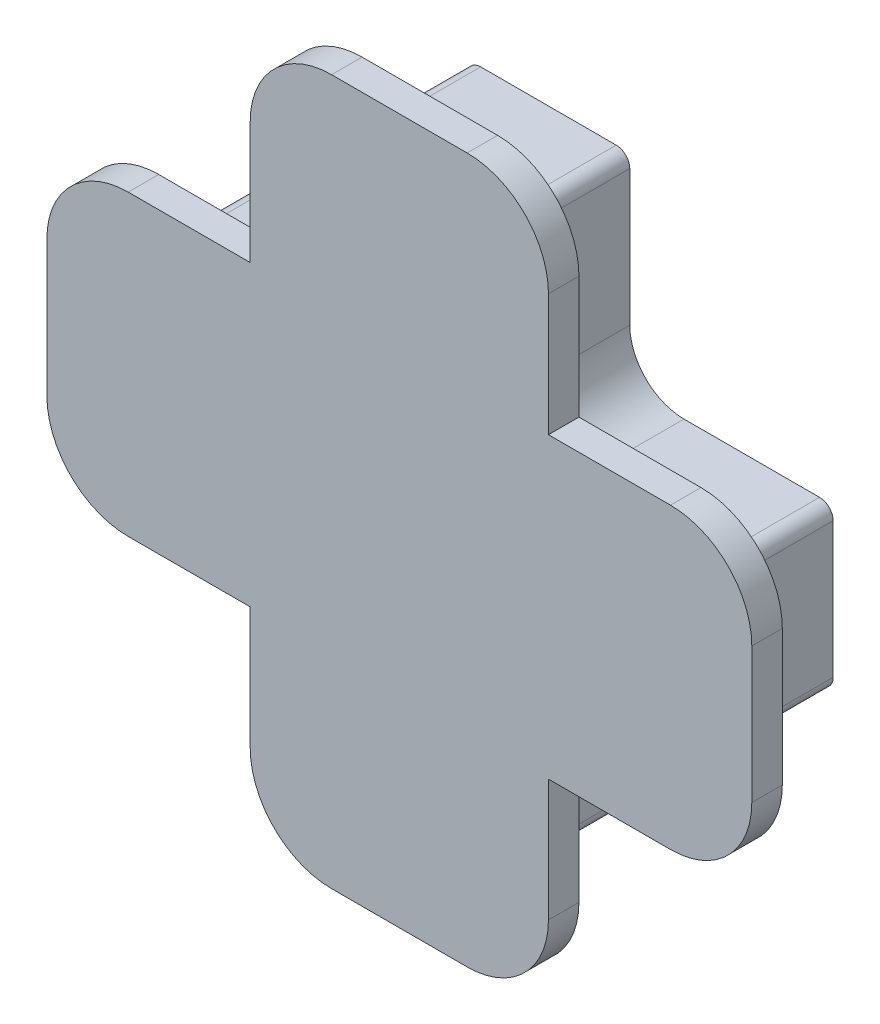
ISO-10303-21;
HEADER;
FILE_DESCRIPTION(('STEP AP214'),'2;1');
FILE_NAME('part.step','',(''),(''),'','','');
FILE_SCHEMA(('AUTOMOTIVE_DESIGN { 1 0 10303 214 1 1 1 1 }'));
ENDSEC;
DATA;
#1=APPLICATION_CONTEXT('core data for automotive mechanical design processes');
#2=APPLICATION_PROTOCOL_DEFINITION('international standard','automotive_design',2000,#1);
#3=PRODUCT_CONTEXT('',#1,'mechanical');
#4=PRODUCT('Part','Part','',(#3));
#5=PRODUCT_RELATED_PRODUCT_CATEGORY('part','',(#4));
#6=PRODUCT_DEFINITION_FORMATION('','',#4);
#7=PRODUCT_DEFINITION_CONTEXT('part definition',#1,'design');
#8=PRODUCT_DEFINITION('design','',#6,#7);
#9=PRODUCT_DEFINITION_SHAPE('','',#8);
#10=(LENGTH_UNIT() NAMED_UNIT(*) SI_UNIT(.MILLI.,.METRE.));
#11=(NAMED_UNIT(*) PLANE_ANGLE_UNIT() SI_UNIT($,.RADIAN.));
#12=(NAMED_UNIT(*) SI_UNIT($,.STERADIAN.) SOLID_ANGLE_UNIT());
#13=UNCERTAINTY_MEASURE_WITH_UNIT(LENGTH_MEASURE(1.E-05),#10,'distance_accuracy_value','');
#14=(GEOMETRIC_REPRESENTATION_CONTEXT(3) GLOBAL_UNCERTAINTY_ASSIGNED_CONTEXT((#13)) GLOBAL_UNIT_ASSIGNED_CONTEXT((#10,
#11,#12)) REPRESENTATION_CONTEXT('',''));
#15=CARTESIAN_POINT('',(0.,0.,0.));
#16=DIRECTION('',(0.,0.,1.));
#17=DIRECTION('',(1.,0.,0.));
#18=AXIS2_PLACEMENT_3D('',#15,#16,#17);
#19=CARTESIAN_POINT('',(24.145,-23.495,-39.2628654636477));
#20=DIRECTION('',(0.,0.,1.));
#21=DIRECTION('',(1.,0.,0.));
#22=AXIS2_PLACEMENT_3D('',#19,#20,#21);
#23=CYLINDRICAL_SURFACE('',#22,3.048);
#24=DIRECTION('',(0.,0.,1.));
#25=VECTOR('',#24,1.);
#26=CARTESIAN_POINT('',(21.097,-23.495,-39.2628654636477));
#27=LINE('',#26,#25);
#28=CARTESIAN_POINT('',(21.097,-23.495,-1.905));
#29=VERTEX_POINT('',#28);
#30=CARTESIAN_POINT('',(21.097,-23.495,-0.761999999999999));
#31=VERTEX_POINT('',#30);
#32=EDGE_CURVE('E375',#29,#31,#27,.T.);
#33=ORIENTED_EDGE('',*,*,#32,.T.);
#34=CARTESIAN_POINT('',(24.145,-23.495,-0.761999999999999));
#35=DIRECTION('',(0.,0.,1.));
#36=DIRECTION('',(0.,-1.,0.));
#37=AXIS2_PLACEMENT_3D('',#34,#35,#36);
#38=CIRCLE('',#37,3.048);
#39=CARTESIAN_POINT('',(24.145,-20.447,-0.762));
#40=VERTEX_POINT('',#39);
#41=EDGE_CURVE('E46',#31,#40,#38,.F.);
#42=ORIENTED_EDGE('',*,*,#41,.T.);
#43=DIRECTION('',(0.,0.,1.));
#44=VECTOR('',#43,1.);
#45=CARTESIAN_POINT('',(24.145,-20.447,-39.2628654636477));
#46=LINE('',#45,#44);
#47=CARTESIAN_POINT('',(24.145,-20.447,-1.905));
#48=VERTEX_POINT('',#47);
#49=EDGE_CURVE('E389',#48,#40,#46,.T.);
#50=ORIENTED_EDGE('',*,*,#49,.F.);
#51=CARTESIAN_POINT('',(24.145,-23.495,-1.905));
#52=DIRECTION('',(0.,0.,1.));
#53=DIRECTION('',(1.,0.,0.));
#54=AXIS2_PLACEMENT_3D('',#51,#52,#53);
#55=CIRCLE('',#54,3.048);
#56=EDGE_CURVE('E378',#29,#48,#55,.F.);
#57=ORIENTED_EDGE('',*,*,#56,.F.);
#58=EDGE_LOOP('',(#33,#42,#50,#57));
#59=FACE_BOUND('',#58,.T.);
#60=ADVANCED_FACE('F32',(#59),#23,.T.);
#61=CARTESIAN_POINT('',(29.225,-20.447,-39.2628654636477));
#62=DIRECTION('',(0.,1.,0.));
#63=DIRECTION('',(-1.,0.,0.));
#64=AXIS2_PLACEMENT_3D('',#61,#62,#63);
#65=PLANE('',#64);
#66=ORIENTED_EDGE('',*,*,#49,.T.);
#67=DIRECTION('',(-1.,0.,0.));
#68=VECTOR('',#67,1.);
#69=CARTESIAN_POINT('',(39.893,-20.447,-0.762));
#70=LINE('',#69,#68);
#71=CARTESIAN_POINT('',(29.225,-20.447,-0.762));
#72=VERTEX_POINT('',#71);
#73=EDGE_CURVE('E330',#72,#40,#70,.T.);
#74=ORIENTED_EDGE('',*,*,#73,.F.);
#75=DIRECTION('',(0.,0.,1.));
#76=VECTOR('',#75,1.);
#77=CARTESIAN_POINT('',(29.225,-20.447,-39.2628654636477));
#78=LINE('',#77,#76);
#79=CARTESIAN_POINT('',(29.225,-20.447,-1.905));
#80=VERTEX_POINT('',#79);
#81=EDGE_CURVE('E393',#80,#72,#78,.T.);
#82=ORIENTED_EDGE('',*,*,#81,.F.);
#83=DIRECTION('',(1.,0.,0.));
#84=VECTOR('',#83,1.);
#85=CARTESIAN_POINT('',(29.225,-20.447,-1.905));
#86=LINE('',#85,#84);
#87=EDGE_CURVE('E382',#48,#80,#86,.T.);
#88=ORIENTED_EDGE('',*,*,#87,.F.);
#89=EDGE_LOOP('',(#66,#74,#82,#88));
#90=FACE_BOUND('',#89,.T.);
#91=ADVANCED_FACE('F650',(#90),#65,.T.);
#92=CARTESIAN_POINT('',(29.225,-23.495,-39.2628654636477));
#93=DIRECTION('',(0.,0.,1.));
#94=DIRECTION('',(1.,0.,0.));
#95=AXIS2_PLACEMENT_3D('',#92,#93,#94);
#96=CYLINDRICAL_SURFACE('',#95,3.048);
#97=ORIENTED_EDGE('',*,*,#81,.T.);
#98=CARTESIAN_POINT('',(29.225,-23.495,-0.761999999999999));
#99=DIRECTION('',(0.,0.,1.));
#100=DIRECTION('',(0.,-1.,0.));
#101=AXIS2_PLACEMENT_3D('',#98,#99,#100);
#102=CIRCLE('',#101,3.048);
#103=CARTESIAN_POINT('',(32.273,-23.495,-0.761999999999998));
#104=VERTEX_POINT('',#103);
#105=EDGE_CURVE('E417',#72,#104,#102,.F.);
#106=ORIENTED_EDGE('',*,*,#105,.T.);
#107=DIRECTION('',(0.,0.,1.));
#108=VECTOR('',#107,1.);
#109=CARTESIAN_POINT('',(32.273,-23.495,-39.2628654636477));
#110=LINE('',#109,#108);
#111=CARTESIAN_POINT('',(32.273,-23.495,-1.905));
#112=VERTEX_POINT('',#111);
#113=EDGE_CURVE('E396',#112,#104,#110,.T.);
#114=ORIENTED_EDGE('',*,*,#113,.F.);
#115=CARTESIAN_POINT('',(29.225,-23.495,-1.905));
#116=DIRECTION('',(0.,0.,1.));
#117=DIRECTION('',(1.,0.,0.));
#118=AXIS2_PLACEMENT_3D('',#115,#116,#117);
#119=CIRCLE('',#118,3.048);
#120=EDGE_CURVE('E385',#80,#112,#119,.F.);
#121=ORIENTED_EDGE('',*,*,#120,.F.);
#122=EDGE_LOOP('',(#97,#106,#114,#121));
#123=FACE_BOUND('',#122,.T.);
#124=ADVANCED_FACE('F647',(#123),#96,.T.);
#125=CARTESIAN_POINT('',(32.273,-28.067,-39.2628654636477));
#126=DIRECTION('',(1.,0.,0.));
#127=DIRECTION('',(0.,0.,-1.));
#128=AXIS2_PLACEMENT_3D('',#125,#126,#127);
#129=PLANE('',#128);
#130=ORIENTED_EDGE('',*,*,#113,.T.);
#131=DIRECTION('',(0.,-1.,0.));
#132=VECTOR('',#131,1.);
#133=CARTESIAN_POINT('',(32.273,-28.067,-0.761999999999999));
#134=LINE('',#133,#132);
#135=CARTESIAN_POINT('',(32.273,-28.067,-0.761999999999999));
#136=VERTEX_POINT('',#135);
#137=EDGE_CURVE('E415',#104,#136,#134,.T.);
#138=ORIENTED_EDGE('',*,*,#137,.T.);
#139=DIRECTION('',(0.,0.,1.));
#140=VECTOR('',#139,1.);
#141=CARTESIAN_POINT('',(32.273,-28.067,-39.2628654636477));
#142=LINE('',#141,#140);
#143=CARTESIAN_POINT('',(32.273,-28.067,-1.905));
#144=VERTEX_POINT('',#143);
#145=EDGE_CURVE('E399',#144,#136,#142,.T.);
#146=ORIENTED_EDGE('',*,*,#145,.F.);
#147=DIRECTION('',(0.,-1.,0.));
#148=VECTOR('',#147,1.);
#149=CARTESIAN_POINT('',(32.273,-28.067,-1.905));
#150=LINE('',#149,#148);
#151=EDGE_CURVE('E638',#112,#144,#150,.T.);
#152=ORIENTED_EDGE('',*,*,#151,.F.);
#153=EDGE_LOOP('',(#130,#138,#146,#152));
#154=FACE_BOUND('',#153,.T.);
#155=ADVANCED_FACE('F646',(#154),#129,.T.);
#156=CARTESIAN_POINT('',(36.845,-28.067,-39.2628654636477));
#157=DIRECTION('',(0.,1.,0.));
#158=DIRECTION('',(-1.,0.,0.));
#159=AXIS2_PLACEMENT_3D('',#156,#157,#158);
#160=PLANE('',#159);
#161=ORIENTED_EDGE('',*,*,#145,.T.);
#162=DIRECTION('',(1.,0.,0.));
#163=VECTOR('',#162,1.);
#164=CARTESIAN_POINT('',(36.845,-28.067,-0.761999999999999));
#165=LINE('',#164,#163);
#166=CARTESIAN_POINT('',(36.845,-28.067,-0.761999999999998));
#167=VERTEX_POINT('',#166);
#168=EDGE_CURVE('E413',#136,#167,#165,.T.);
#169=ORIENTED_EDGE('',*,*,#168,.T.);
#170=DIRECTION('',(0.,0.,1.));
#171=VECTOR('',#170,1.);
#172=CARTESIAN_POINT('',(36.845,-28.067,-39.2628654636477));
#173=LINE('',#172,#171);
#174=CARTESIAN_POINT('',(36.845,-28.067,-1.905));
#175=VERTEX_POINT('',#174);
#176=EDGE_CURVE('E337',#175,#167,#173,.T.);
#177=ORIENTED_EDGE('',*,*,#176,.F.);
#178=DIRECTION('',(1.,0.,0.));
#179=VECTOR('',#178,1.);
#180=CARTESIAN_POINT('',(36.845,-28.067,-1.905));
#181=LINE('',#180,#179);
#182=EDGE_CURVE('E411',#144,#175,#181,.T.);
#183=ORIENTED_EDGE('',*,*,#182,.F.);
#184=EDGE_LOOP('',(#161,#169,#177,#183));
#185=FACE_BOUND('',#184,.T.);
#186=ADVANCED_FACE('F410',(#185),#160,.T.);
#187=CARTESIAN_POINT('',(36.845,-31.115,-39.2628654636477));
#188=DIRECTION('',(0.,0.,1.));
#189=DIRECTION('',(1.,0.,0.));
#190=AXIS2_PLACEMENT_3D('',#187,#188,#189);
#191=CYLINDRICAL_SURFACE('',#190,3.048);
#192=ORIENTED_EDGE('',*,*,#176,.T.);
#193=CARTESIAN_POINT('',(36.845,-31.115,-0.761999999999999));
#194=DIRECTION('',(0.,0.,1.));
#195=DIRECTION('',(0.,-1.,0.));
#196=AXIS2_PLACEMENT_3D('',#193,#194,#195);
#197=CIRCLE('',#196,3.048);
#198=CARTESIAN_POINT('',(39.893,-31.115,-0.762000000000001));
#199=VERTEX_POINT('',#198);
#200=EDGE_CURVE('E320',#167,#199,#197,.F.);
#201=ORIENTED_EDGE('',*,*,#200,.T.);
#202=DIRECTION('',(0.,0.,1.));
#203=VECTOR('',#202,1.);
#204=CARTESIAN_POINT('',(39.893,-31.115,-39.2628654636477));
#205=LINE('',#204,#203);
#206=CARTESIAN_POINT('',(39.893,-31.115,-1.905));
#207=VERTEX_POINT('',#206);
#208=EDGE_CURVE('E329',#207,#199,#205,.T.);
#209=ORIENTED_EDGE('',*,*,#208,.F.);
#210=CARTESIAN_POINT('',(36.845,-31.115,-1.905));
#211=DIRECTION('',(0.,0.,1.));
#212=DIRECTION('',(1.,0.,0.));
#213=AXIS2_PLACEMENT_3D('',#210,#211,#212);
#214=CIRCLE('',#213,3.048);
#215=EDGE_CURVE('E406',#175,#207,#214,.F.);
#216=ORIENTED_EDGE('',*,*,#215,.F.);
#217=EDGE_LOOP('',(#192,#201,#209,#216));
#218=FACE_BOUND('',#217,.T.);
#219=ADVANCED_FACE('F405',(#218),#191,.T.);
#220=CARTESIAN_POINT('',(39.893,-36.195,-39.2628654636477));
#221=DIRECTION('',(1.,0.,0.));
#222=DIRECTION('',(0.,0.,-1.));
#223=AXIS2_PLACEMENT_3D('',#220,#221,#222);
#224=PLANE('',#223);
#225=ORIENTED_EDGE('',*,*,#208,.T.);
#226=DIRECTION('',(0.,1.,0.));
#227=VECTOR('',#226,1.);
#228=CARTESIAN_POINT('',(39.893,-20.447,-0.762));
#229=LINE('',#228,#227);
#230=CARTESIAN_POINT('',(39.893,-36.195,-0.762000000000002));
#231=VERTEX_POINT('',#230);
#232=EDGE_CURVE('E312',#231,#199,#229,.T.);
#233=ORIENTED_EDGE('',*,*,#232,.F.);
#234=DIRECTION('',(0.,0.,1.));
#235=VECTOR('',#234,1.);
#236=CARTESIAN_POINT('',(39.893,-36.195,-39.2628654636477));
#237=LINE('',#236,#235);
#238=CARTESIAN_POINT('',(39.893,-36.195,-1.905));
#239=VERTEX_POINT('',#238);
#240=EDGE_CURVE('E327',#239,#231,#237,.T.);
#241=ORIENTED_EDGE('',*,*,#240,.F.);
#242=DIRECTION('',(0.,-1.,0.));
#243=VECTOR('',#242,1.);
#244=CARTESIAN_POINT('',(39.893,-36.195,-1.905));
#245=LINE('',#244,#243);
#246=EDGE_CURVE('E634',#207,#239,#245,.T.);
#247=ORIENTED_EDGE('',*,*,#246,.F.);
#248=EDGE_LOOP('',(#225,#233,#241,#247));
#249=FACE_BOUND('',#248,.T.);
#250=ADVANCED_FACE('F325',(#249),#224,.T.);
#251=CARTESIAN_POINT('',(36.845,-36.195,-39.2628654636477));
#252=DIRECTION('',(0.,0.,1.));
#253=DIRECTION('',(1.,0.,0.));
#254=AXIS2_PLACEMENT_3D('',#251,#252,#253);
#255=CYLINDRICAL_SURFACE('',#254,3.048);
#256=ORIENTED_EDGE('',*,*,#240,.T.);
#257=CARTESIAN_POINT('',(36.845,-36.195,-0.761999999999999));
#258=DIRECTION('',(0.,0.,1.));
#259=DIRECTION('',(0.,-1.,0.));
#260=AXIS2_PLACEMENT_3D('',#257,#258,#259);
#261=CIRCLE('',#260,3.048);
#262=CARTESIAN_POINT('',(36.845,-39.243,-0.761999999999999));
#263=VERTEX_POINT('',#262);
#264=EDGE_CURVE('E309',#231,#263,#261,.F.);
#265=ORIENTED_EDGE('',*,*,#264,.T.);
#266=DIRECTION('',(0.,0.,1.));
#267=VECTOR('',#266,1.);
#268=CARTESIAN_POINT('',(36.845,-39.243,-39.2628654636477));
#269=LINE('',#268,#267);
#270=CARTESIAN_POINT('',(36.845,-39.243,-1.905));
#271=VERTEX_POINT('',#270);
#272=EDGE_CURVE('E335',#271,#263,#269,.T.);
#273=ORIENTED_EDGE('',*,*,#272,.F.);
#274=CARTESIAN_POINT('',(36.845,-36.195,-1.905));
#275=DIRECTION('',(0.,0.,1.));
#276=DIRECTION('',(1.,0.,0.));
#277=AXIS2_PLACEMENT_3D('',#274,#275,#276);
#278=CIRCLE('',#277,3.048);
#279=EDGE_CURVE('E334',#239,#271,#278,.F.);
#280=ORIENTED_EDGE('',*,*,#279,.F.);
#281=EDGE_LOOP('',(#256,#265,#273,#280));
#282=FACE_BOUND('',#281,.T.);
#283=ADVANCED_FACE('F333',(#282),#255,.T.);
#284=CARTESIAN_POINT('',(32.273,-39.243,-39.2628654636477));
#285=DIRECTION('',(0.,-1.,0.));
#286=DIRECTION('',(0.,0.,-1.));
#287=AXIS2_PLACEMENT_3D('',#284,#285,#286);
#288=PLANE('',#287);
#289=ORIENTED_EDGE('',*,*,#272,.T.);
#290=DIRECTION('',(-1.,0.,0.));
#291=VECTOR('',#290,1.);
#292=CARTESIAN_POINT('',(32.273,-39.243,-0.761999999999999));
#293=LINE('',#292,#291);
#294=CARTESIAN_POINT('',(32.273,-39.243,-0.761999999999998));
#295=VERTEX_POINT('',#294);
#296=EDGE_CURVE('E315',#263,#295,#293,.T.);
#297=ORIENTED_EDGE('',*,*,#296,.T.);
#298=DIRECTION('',(0.,0.,1.));
#299=VECTOR('',#298,1.);
#300=CARTESIAN_POINT('',(32.273,-39.243,-39.2628654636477));
#301=LINE('',#300,#299);
#302=CARTESIAN_POINT('',(32.273,-39.243,-1.905));
#303=VERTEX_POINT('',#302);
#304=EDGE_CURVE('E339',#303,#295,#301,.T.);
#305=ORIENTED_EDGE('',*,*,#304,.F.);
#306=DIRECTION('',(-1.,0.,0.));
#307=VECTOR('',#306,1.);
#308=CARTESIAN_POINT('',(32.273,-39.243,-1.905));
#309=LINE('',#308,#307);
#310=EDGE_CURVE('E631',#271,#303,#309,.T.);
#311=ORIENTED_EDGE('',*,*,#310,.F.);
#312=EDGE_LOOP('',(#289,#297,#305,#311));
#313=FACE_BOUND('',#312,.T.);
#314=ADVANCED_FACE('F687',(#313),#288,.T.);
#315=CARTESIAN_POINT('',(32.273,-43.815,-39.2628654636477));
#316=DIRECTION('',(1.,0.,0.));
#317=DIRECTION('',(0.,0.,-1.));
#318=AXIS2_PLACEMENT_3D('',#315,#316,#317);
#319=PLANE('',#318);
#320=ORIENTED_EDGE('',*,*,#304,.T.);
#321=DIRECTION('',(0.,-1.,0.));
#322=VECTOR('',#321,1.);
#323=CARTESIAN_POINT('',(32.273,-43.815,-0.761999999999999));
#324=LINE('',#323,#322);
#325=CARTESIAN_POINT('',(32.273,-43.815,-0.761999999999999));
#326=VERTEX_POINT('',#325);
#327=EDGE_CURVE('E682',#295,#326,#324,.T.);
#328=ORIENTED_EDGE('',*,*,#327,.T.);
#329=DIRECTION('',(0.,0.,1.));
#330=VECTOR('',#329,1.);
#331=CARTESIAN_POINT('',(32.273,-43.815,-39.2628654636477));
#332=LINE('',#331,#330);
#333=CARTESIAN_POINT('',(32.273,-43.815,-1.905));
#334=VERTEX_POINT('',#333);
#335=EDGE_CURVE('E345',#334,#326,#332,.T.);
#336=ORIENTED_EDGE('',*,*,#335,.F.);
#337=DIRECTION('',(0.,-1.,0.));
#338=VECTOR('',#337,1.);
#339=CARTESIAN_POINT('',(32.273,-43.815,-1.905));
#340=LINE('',#339,#338);
#341=EDGE_CURVE('E629',#303,#334,#340,.T.);
#342=ORIENTED_EDGE('',*,*,#341,.F.);
#343=EDGE_LOOP('',(#320,#328,#336,#342));
#344=FACE_BOUND('',#343,.T.);
#345=ADVANCED_FACE('F691',(#344),#319,.T.);
#346=CARTESIAN_POINT('',(29.225,-43.815,-39.2628654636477));
#347=DIRECTION('',(0.,0.,1.));
#348=DIRECTION('',(1.,0.,0.));
#349=AXIS2_PLACEMENT_3D('',#346,#347,#348);
#350=CYLINDRICAL_SURFACE('',#349,3.048);
#351=ORIENTED_EDGE('',*,*,#335,.T.);
#352=CARTESIAN_POINT('',(29.225,-43.815,-0.761999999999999));
#353=DIRECTION('',(0.,0.,1.));
#354=DIRECTION('',(0.,-1.,0.));
#355=AXIS2_PLACEMENT_3D('',#352,#353,#354);
#356=CIRCLE('',#355,3.048);
#357=CARTESIAN_POINT('',(29.225,-46.863,-0.762000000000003));
#358=VERTEX_POINT('',#357);
#359=EDGE_CURVE('E679',#326,#358,#356,.F.);
#360=ORIENTED_EDGE('',*,*,#359,.T.);
#361=DIRECTION('',(0.,0.,1.));
#362=VECTOR('',#361,1.);
#363=CARTESIAN_POINT('',(29.225,-46.863,-39.2628654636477));
#364=LINE('',#363,#362);
#365=CARTESIAN_POINT('',(29.225,-46.863,-1.905));
#366=VERTEX_POINT('',#365);
#367=EDGE_CURVE('E348',#366,#358,#364,.T.);
#368=ORIENTED_EDGE('',*,*,#367,.F.);
#369=CARTESIAN_POINT('',(29.225,-43.815,-1.905));
#370=DIRECTION('',(0.,0.,1.));
#371=DIRECTION('',(1.,0.,0.));
#372=AXIS2_PLACEMENT_3D('',#369,#370,#371);
#373=CIRCLE('',#372,3.048);
#374=EDGE_CURVE('E627',#334,#366,#373,.F.);
#375=ORIENTED_EDGE('',*,*,#374,.F.);
#376=EDGE_LOOP('',(#351,#360,#368,#375));
#377=FACE_BOUND('',#376,.T.);
#378=ADVANCED_FACE('F697',(#377),#350,.T.);
#379=CARTESIAN_POINT('',(24.145,-46.863,-39.2628654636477));
#380=DIRECTION('',(0.,-1.,0.));
#381=DIRECTION('',(0.,0.,-1.));
#382=AXIS2_PLACEMENT_3D('',#379,#380,#381);
#383=PLANE('',#382);
#384=ORIENTED_EDGE('',*,*,#367,.T.);
#385=DIRECTION('',(-1.,0.,0.));
#386=VECTOR('',#385,1.);
#387=CARTESIAN_POINT('',(39.893,-46.863,-0.762000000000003));
#388=LINE('',#387,#386);
#389=CARTESIAN_POINT('',(24.145,-46.863,-0.761999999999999));
#390=VERTEX_POINT('',#389);
#391=EDGE_CURVE('E652',#358,#390,#388,.T.);
#392=ORIENTED_EDGE('',*,*,#391,.T.);
#393=DIRECTION('',(0.,0.,1.));
#394=VECTOR('',#393,1.);
#395=CARTESIAN_POINT('',(24.145,-46.863,-39.2628654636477));
#396=LINE('',#395,#394);
#397=CARTESIAN_POINT('',(24.145,-46.863,-1.905));
#398=VERTEX_POINT('',#397);
#399=EDGE_CURVE('E351',#398,#390,#396,.T.);
#400=ORIENTED_EDGE('',*,*,#399,.F.);
#401=DIRECTION('',(-1.,0.,0.));
#402=VECTOR('',#401,1.);
#403=CARTESIAN_POINT('',(24.145,-46.863,-1.905));
#404=LINE('',#403,#402);
#405=EDGE_CURVE('E625',#366,#398,#404,.T.);
#406=ORIENTED_EDGE('',*,*,#405,.F.);
#407=EDGE_LOOP('',(#384,#392,#400,#406));
#408=FACE_BOUND('',#407,.T.);
#409=ADVANCED_FACE('F699',(#408),#383,.T.);
#410=CARTESIAN_POINT('',(24.145,-43.815,-39.2628654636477));
#411=DIRECTION('',(0.,0.,1.));
#412=DIRECTION('',(1.,0.,0.));
#413=AXIS2_PLACEMENT_3D('',#410,#411,#412);
#414=CYLINDRICAL_SURFACE('',#413,3.048);
#415=ORIENTED_EDGE('',*,*,#399,.T.);
#416=CARTESIAN_POINT('',(24.145,-43.815,-0.761999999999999));
#417=DIRECTION('',(0.,0.,1.));
#418=DIRECTION('',(0.,-1.,0.));
#419=AXIS2_PLACEMENT_3D('',#416,#417,#418);
#420=CIRCLE('',#419,3.048);
#421=CARTESIAN_POINT('',(21.097,-43.815,-0.761999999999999));
#422=VERTEX_POINT('',#421);
#423=EDGE_CURVE('E675',#390,#422,#420,.F.);
#424=ORIENTED_EDGE('',*,*,#423,.T.);
#425=DIRECTION('',(0.,0.,1.));
#426=VECTOR('',#425,1.);
#427=CARTESIAN_POINT('',(21.097,-43.815,-39.2628654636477));
#428=LINE('',#427,#426);
#429=CARTESIAN_POINT('',(21.097,-43.815,-1.905));
#430=VERTEX_POINT('',#429);
#431=EDGE_CURVE('E354',#430,#422,#428,.T.);
#432=ORIENTED_EDGE('',*,*,#431,.F.);
#433=CARTESIAN_POINT('',(24.145,-43.815,-1.905));
#434=DIRECTION('',(0.,0.,1.));
#435=DIRECTION('',(1.,0.,0.));
#436=AXIS2_PLACEMENT_3D('',#433,#434,#435);
#437=CIRCLE('',#436,3.048);
#438=EDGE_CURVE('E623',#398,#430,#437,.F.);
#439=ORIENTED_EDGE('',*,*,#438,.F.);
#440=EDGE_LOOP('',(#415,#424,#432,#439));
#441=FACE_BOUND('',#440,.T.);
#442=ADVANCED_FACE('F705',(#441),#414,.T.);
#443=CARTESIAN_POINT('',(21.097,-39.243,-39.2628654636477));
#444=DIRECTION('',(-1.,0.,0.));
#445=DIRECTION('',(0.,-1.,0.));
#446=AXIS2_PLACEMENT_3D('',#443,#444,#445);
#447=PLANE('',#446);
#448=ORIENTED_EDGE('',*,*,#431,.T.);
#449=DIRECTION('',(0.,1.,0.));
#450=VECTOR('',#449,1.);
#451=CARTESIAN_POINT('',(21.097,-39.243,-0.761999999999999));
#452=LINE('',#451,#450);
#453=CARTESIAN_POINT('',(21.097,-39.243,-0.761999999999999));
#454=VERTEX_POINT('',#453);
#455=EDGE_CURVE('E672',#422,#454,#452,.T.);
#456=ORIENTED_EDGE('',*,*,#455,.T.);
#457=DIRECTION('',(0.,0.,1.));
#458=VECTOR('',#457,1.);
#459=CARTESIAN_POINT('',(21.097,-39.243,-39.2628654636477));
#460=LINE('',#459,#458);
#461=CARTESIAN_POINT('',(21.097,-39.243,-1.905));
#462=VERTEX_POINT('',#461);
#463=EDGE_CURVE('E357',#462,#454,#460,.T.);
#464=ORIENTED_EDGE('',*,*,#463,.F.);
#465=DIRECTION('',(0.,1.,0.));
#466=VECTOR('',#465,1.);
#467=CARTESIAN_POINT('',(21.097,-39.243,-1.905));
#468=LINE('',#467,#466);
#469=EDGE_CURVE('E621',#430,#462,#468,.T.);
#470=ORIENTED_EDGE('',*,*,#469,.F.);
#471=EDGE_LOOP('',(#448,#456,#464,#470));
#472=FACE_BOUND('',#471,.T.);
#473=ADVANCED_FACE('F707',(#472),#447,.T.);
#474=CARTESIAN_POINT('',(16.525,-39.243,-39.2628654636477));
#475=DIRECTION('',(0.,-1.,0.));
#476=DIRECTION('',(0.,0.,-1.));
#477=AXIS2_PLACEMENT_3D('',#474,#475,#476);
#478=PLANE('',#477);
#479=ORIENTED_EDGE('',*,*,#463,.T.);
#480=DIRECTION('',(-1.,0.,0.));
#481=VECTOR('',#480,1.);
#482=CARTESIAN_POINT('',(16.525,-39.243,-0.761999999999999));
#483=LINE('',#482,#481);
#484=CARTESIAN_POINT('',(16.525,-39.243,-0.761999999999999));
#485=VERTEX_POINT('',#484);
#486=EDGE_CURVE('E669',#454,#485,#483,.T.);
#487=ORIENTED_EDGE('',*,*,#486,.T.);
#488=DIRECTION('',(0.,0.,1.));
#489=VECTOR('',#488,1.);
#490=CARTESIAN_POINT('',(16.525,-39.243,-39.2628654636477));
#491=LINE('',#490,#489);
#492=CARTESIAN_POINT('',(16.525,-39.243,-1.905));
#493=VERTEX_POINT('',#492);
#494=EDGE_CURVE('E360',#493,#485,#491,.T.);
#495=ORIENTED_EDGE('',*,*,#494,.F.);
#496=DIRECTION('',(-1.,0.,0.));
#497=VECTOR('',#496,1.);
#498=CARTESIAN_POINT('',(16.525,-39.243,-1.905));
#499=LINE('',#498,#497);
#500=EDGE_CURVE('E619',#462,#493,#499,.T.);
#501=ORIENTED_EDGE('',*,*,#500,.F.);
#502=EDGE_LOOP('',(#479,#487,#495,#501));
#503=FACE_BOUND('',#502,.T.);
#504=ADVANCED_FACE('F713',(#503),#478,.T.);
#505=CARTESIAN_POINT('',(16.525,-36.195,-39.2628654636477));
#506=DIRECTION('',(0.,0.,1.));
#507=DIRECTION('',(1.,0.,0.));
#508=AXIS2_PLACEMENT_3D('',#505,#506,#507);
#509=CYLINDRICAL_SURFACE('',#508,3.048);
#510=ORIENTED_EDGE('',*,*,#494,.T.);
#511=CARTESIAN_POINT('',(16.525,-36.195,-0.761999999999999));
#512=DIRECTION('',(0.,0.,1.));
#513=DIRECTION('',(0.,-1.,0.));
#514=AXIS2_PLACEMENT_3D('',#511,#512,#513);
#515=CIRCLE('',#514,3.048);
#516=CARTESIAN_POINT('',(13.477,-36.195,-0.761999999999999));
#517=VERTEX_POINT('',#516);
#518=EDGE_CURVE('E666',#485,#517,#515,.F.);
#519=ORIENTED_EDGE('',*,*,#518,.T.);
#520=DIRECTION('',(0.,0.,1.));
#521=VECTOR('',#520,1.);
#522=CARTESIAN_POINT('',(13.477,-36.195,-39.2628654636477));
#523=LINE('',#522,#521);
#524=CARTESIAN_POINT('',(13.477,-36.195,-1.905));
#525=VERTEX_POINT('',#524);
#526=EDGE_CURVE('E363',#525,#517,#523,.T.);
#527=ORIENTED_EDGE('',*,*,#526,.F.);
#528=CARTESIAN_POINT('',(16.525,-36.195,-1.905));
#529=DIRECTION('',(0.,0.,1.));
#530=DIRECTION('',(1.,0.,0.));
#531=AXIS2_PLACEMENT_3D('',#528,#529,#530);
#532=CIRCLE('',#531,3.048);
#533=EDGE_CURVE('E617',#493,#525,#532,.F.);
#534=ORIENTED_EDGE('',*,*,#533,.F.);
#535=EDGE_LOOP('',(#510,#519,#527,#534));
#536=FACE_BOUND('',#535,.T.);
#537=ADVANCED_FACE('F715',(#536),#509,.T.);
#538=CARTESIAN_POINT('',(13.477,-31.115,-39.2628654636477));
#539=DIRECTION('',(-1.,0.,0.));
#540=DIRECTION('',(0.,-1.,0.));
#541=AXIS2_PLACEMENT_3D('',#538,#539,#540);
#542=PLANE('',#541);
#543=ORIENTED_EDGE('',*,*,#526,.T.);
#544=DIRECTION('',(0.,1.,0.));
#545=VECTOR('',#544,1.);
#546=CARTESIAN_POINT('',(13.477,-31.115,-0.761999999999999));
#547=LINE('',#546,#545);
#548=CARTESIAN_POINT('',(13.477,-31.115,-0.761999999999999));
#549=VERTEX_POINT('',#548);
#550=EDGE_CURVE('E663',#517,#549,#547,.T.);
#551=ORIENTED_EDGE('',*,*,#550,.T.);
#552=DIRECTION('',(0.,0.,1.));
#553=VECTOR('',#552,1.);
#554=CARTESIAN_POINT('',(13.477,-31.115,-39.2628654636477));
#555=LINE('',#554,#553);
#556=CARTESIAN_POINT('',(13.477,-31.115,-1.905));
#557=VERTEX_POINT('',#556);
#558=EDGE_CURVE('E366',#557,#549,#555,.T.);
#559=ORIENTED_EDGE('',*,*,#558,.F.);
#560=DIRECTION('',(0.,1.,0.));
#561=VECTOR('',#560,1.);
#562=CARTESIAN_POINT('',(13.477,-31.115,-1.905));
#563=LINE('',#562,#561);
#564=EDGE_CURVE('E615',#525,#557,#563,.T.);
#565=ORIENTED_EDGE('',*,*,#564,.F.);
#566=EDGE_LOOP('',(#543,#551,#559,#565));
#567=FACE_BOUND('',#566,.T.);
#568=ADVANCED_FACE('F721',(#567),#542,.T.);
#569=CARTESIAN_POINT('',(16.525,-31.115,-39.2628654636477));
#570=DIRECTION('',(0.,0.,1.));
#571=DIRECTION('',(1.,0.,0.));
#572=AXIS2_PLACEMENT_3D('',#569,#570,#571);
#573=CYLINDRICAL_SURFACE('',#572,3.048);
#574=ORIENTED_EDGE('',*,*,#558,.T.);
#575=CARTESIAN_POINT('',(16.525,-31.115,-0.761999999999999));
#576=DIRECTION('',(0.,0.,1.));
#577=DIRECTION('',(0.,-1.,0.));
#578=AXIS2_PLACEMENT_3D('',#575,#576,#577);
#579=CIRCLE('',#578,3.048);
#580=CARTESIAN_POINT('',(16.525,-28.067,-0.761999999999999));
#581=VERTEX_POINT('',#580);
#582=EDGE_CURVE('E660',#549,#581,#579,.F.);
#583=ORIENTED_EDGE('',*,*,#582,.T.);
#584=DIRECTION('',(0.,0.,1.));
#585=VECTOR('',#584,1.);
#586=CARTESIAN_POINT('',(16.525,-28.067,-39.2628654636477));
#587=LINE('',#586,#585);
#588=CARTESIAN_POINT('',(16.525,-28.067,-1.905));
#589=VERTEX_POINT('',#588);
#590=EDGE_CURVE('E369',#589,#581,#587,.T.);
#591=ORIENTED_EDGE('',*,*,#590,.F.);
#592=CARTESIAN_POINT('',(16.525,-31.115,-1.905));
#593=DIRECTION('',(0.,0.,1.));
#594=DIRECTION('',(1.,0.,0.));
#595=AXIS2_PLACEMENT_3D('',#592,#593,#594);
#596=CIRCLE('',#595,3.048);
#597=EDGE_CURVE('E613',#557,#589,#596,.F.);
#598=ORIENTED_EDGE('',*,*,#597,.F.);
#599=EDGE_LOOP('',(#574,#583,#591,#598));
#600=FACE_BOUND('',#599,.T.);
#601=ADVANCED_FACE('F723',(#600),#573,.T.);
#602=CARTESIAN_POINT('',(21.097,-28.067,-39.2628654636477));
#603=DIRECTION('',(0.,1.,0.));
#604=DIRECTION('',(0.,0.,1.));
#605=AXIS2_PLACEMENT_3D('',#602,#603,#604);
#606=PLANE('',#605);
#607=ORIENTED_EDGE('',*,*,#590,.T.);
#608=DIRECTION('',(1.,0.,0.));
#609=VECTOR('',#608,1.);
#610=CARTESIAN_POINT('',(21.097,-28.067,-0.761999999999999));
#611=LINE('',#610,#609);
#612=CARTESIAN_POINT('',(21.097,-28.067,-0.761999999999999));
#613=VERTEX_POINT('',#612);
#614=EDGE_CURVE('E655',#581,#613,#611,.T.);
#615=ORIENTED_EDGE('',*,*,#614,.T.);
#616=DIRECTION('',(0.,0.,1.));
#617=VECTOR('',#616,1.);
#618=CARTESIAN_POINT('',(21.097,-28.067,-39.2628654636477));
#619=LINE('',#618,#617);
#620=CARTESIAN_POINT('',(21.097,-28.067,-1.905));
#621=VERTEX_POINT('',#620);
#622=EDGE_CURVE('E372',#621,#613,#619,.T.);
#623=ORIENTED_EDGE('',*,*,#622,.F.);
#624=DIRECTION('',(1.,0.,0.));
#625=VECTOR('',#624,1.);
#626=CARTESIAN_POINT('',(21.097,-28.067,-1.905));
#627=LINE('',#626,#625);
#628=EDGE_CURVE('E392',#589,#621,#627,.T.);
#629=ORIENTED_EDGE('',*,*,#628,.F.);
#630=EDGE_LOOP('',(#607,#615,#623,#629));
#631=FACE_BOUND('',#630,.T.);
#632=ADVANCED_FACE('F728',(#631),#606,.T.);
#633=CARTESIAN_POINT('',(21.097,-23.495,-39.2628654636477));
#634=DIRECTION('',(-1.,0.,0.));
#635=DIRECTION('',(0.,0.,1.));
#636=AXIS2_PLACEMENT_3D('',#633,#634,#635);
#637=PLANE('',#636);
#638=ORIENTED_EDGE('',*,*,#622,.T.);
#639=DIRECTION('',(0.,1.,0.));
#640=VECTOR('',#639,1.);
#641=CARTESIAN_POINT('',(21.097,-23.495,-0.761999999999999));
#642=LINE('',#641,#640);
#643=EDGE_CURVE('E11',#613,#31,#642,.T.);
#644=ORIENTED_EDGE('',*,*,#643,.T.);
#645=ORIENTED_EDGE('',*,*,#32,.F.);
#646=DIRECTION('',(0.,1.,0.));
#647=VECTOR('',#646,1.);
#648=CARTESIAN_POINT('',(21.097,-23.495,-1.905));
#649=LINE('',#648,#647);
#650=EDGE_CURVE('E39',#621,#29,#649,.T.);
#651=ORIENTED_EDGE('',*,*,#650,.F.);
#652=EDGE_LOOP('',(#638,#644,#645,#651));
#653=FACE_BOUND('',#652,.T.);
#654=ADVANCED_FACE('F731',(#653),#637,.T.);
#655=CARTESIAN_POINT('',(0.,0.,-1.905));
#656=DIRECTION('',(0.,0.,1.));
#657=DIRECTION('',(0.,-1.,0.));
#658=AXIS2_PLACEMENT_3D('',#655,#656,#657);
#659=PLANE('',#658);
#660=ORIENTED_EDGE('',*,*,#56,.T.);
#661=ORIENTED_EDGE('',*,*,#87,.T.);
#662=ORIENTED_EDGE('',*,*,#120,.T.);
#663=ORIENTED_EDGE('',*,*,#151,.T.);
#664=ORIENTED_EDGE('',*,*,#182,.T.);
#665=ORIENTED_EDGE('',*,*,#215,.T.);
#666=ORIENTED_EDGE('',*,*,#246,.T.);
#667=ORIENTED_EDGE('',*,*,#279,.T.);
#668=ORIENTED_EDGE('',*,*,#310,.T.);
#669=ORIENTED_EDGE('',*,*,#341,.T.);
#670=ORIENTED_EDGE('',*,*,#374,.T.);
#671=ORIENTED_EDGE('',*,*,#405,.T.);
#672=ORIENTED_EDGE('',*,*,#438,.T.);
#673=ORIENTED_EDGE('',*,*,#469,.T.);
#674=ORIENTED_EDGE('',*,*,#500,.T.);
#675=ORIENTED_EDGE('',*,*,#533,.T.);
#676=ORIENTED_EDGE('',*,*,#564,.T.);
#677=ORIENTED_EDGE('',*,*,#597,.T.);
#678=ORIENTED_EDGE('',*,*,#628,.T.);
#679=ORIENTED_EDGE('',*,*,#650,.T.);
#680=EDGE_LOOP('',(#660,#661,#662,#663,#664,#665,#666,#667,#668,#669,#670,#671,#672,#673,#674,
#675,#676,#677,#678,#679));
#681=FACE_BOUND('',#680,.T.);
#682=CARTESIAN_POINT('',(21.605,-28.575,-1.905));
#683=DIRECTION('',(0.,0.,1.));
#684=DIRECTION('',(-1.,0.,0.));
#685=AXIS2_PLACEMENT_3D('',#682,#683,#684);
#686=CIRCLE('',#685,2.032);
#687=CARTESIAN_POINT('',(21.605,-30.607,-1.905));
#688=VERTEX_POINT('',#687);
#689=CARTESIAN_POINT('',(23.637,-28.575,-1.905));
#690=VERTEX_POINT('',#689);
#691=EDGE_CURVE('E423',#688,#690,#686,.T.);
#692=ORIENTED_EDGE('',*,*,#691,.F.);
#693=DIRECTION('',(1.,0.,0.));
#694=VECTOR('',#693,1.);
#695=CARTESIAN_POINT('',(16.525,-30.607,-1.905));
#696=LINE('',#695,#694);
#697=CARTESIAN_POINT('',(16.525,-30.607,-1.905));
#698=VERTEX_POINT('',#697);
#699=EDGE_CURVE('E428',#698,#688,#696,.T.);
#700=ORIENTED_EDGE('',*,*,#699,.F.);
#701=CARTESIAN_POINT('',(16.525,-31.115,-1.905));
#702=DIRECTION('',(0.,0.,-1.));
#703=DIRECTION('',(-1.,0.,0.));
#704=AXIS2_PLACEMENT_3D('',#701,#702,#703);
#705=CIRCLE('',#704,0.508000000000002);
#706=CARTESIAN_POINT('',(16.017,-31.115,-1.905));
#707=VERTEX_POINT('',#706);
#708=EDGE_CURVE('E538',#707,#698,#705,.T.);
#709=ORIENTED_EDGE('',*,*,#708,.F.);
#710=DIRECTION('',(0.,1.,0.));
#711=VECTOR('',#710,1.);
#712=CARTESIAN_POINT('',(16.017,-36.195,-1.905));
#713=LINE('',#712,#711);
#714=CARTESIAN_POINT('',(16.017,-36.195,-1.905));
#715=VERTEX_POINT('',#714);
#716=EDGE_CURVE('E535',#715,#707,#713,.T.);
#717=ORIENTED_EDGE('',*,*,#716,.F.);
#718=CARTESIAN_POINT('',(16.525,-36.195,-1.905));
#719=DIRECTION('',(0.,0.,-1.));
#720=DIRECTION('',(-1.,0.,0.));
#721=AXIS2_PLACEMENT_3D('',#718,#719,#720);
#722=CIRCLE('',#721,0.508000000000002);
#723=CARTESIAN_POINT('',(16.525,-36.703,-1.905));
#724=VERTEX_POINT('',#723);
#725=EDGE_CURVE('E532',#724,#715,#722,.T.);
#726=ORIENTED_EDGE('',*,*,#725,.F.);
#727=DIRECTION('',(-1.,0.,0.));
#728=VECTOR('',#727,1.);
#729=CARTESIAN_POINT('',(21.605,-36.703,-1.905));
#730=LINE('',#729,#728);
#731=CARTESIAN_POINT('',(21.605,-36.703,-1.905));
#732=VERTEX_POINT('',#731);
#733=EDGE_CURVE('E529',#732,#724,#730,.T.);
#734=ORIENTED_EDGE('',*,*,#733,.F.);
#735=CARTESIAN_POINT('',(21.605,-38.735,-1.905));
#736=DIRECTION('',(0.,0.,1.));
#737=DIRECTION('',(-1.,0.,0.));
#738=AXIS2_PLACEMENT_3D('',#735,#736,#737);
#739=CIRCLE('',#738,2.032);
#740=CARTESIAN_POINT('',(23.637,-38.735,-1.905));
#741=VERTEX_POINT('',#740);
#742=EDGE_CURVE('E526',#741,#732,#739,.T.);
#743=ORIENTED_EDGE('',*,*,#742,.F.);
#744=DIRECTION('',(0.,1.,0.));
#745=VECTOR('',#744,1.);
#746=CARTESIAN_POINT('',(23.637,-43.815,-1.905));
#747=LINE('',#746,#745);
#748=CARTESIAN_POINT('',(23.637,-43.815,-1.905));
#749=VERTEX_POINT('',#748);
#750=EDGE_CURVE('E523',#749,#741,#747,.T.);
#751=ORIENTED_EDGE('',*,*,#750,.F.);
#752=CARTESIAN_POINT('',(24.145,-43.815,-1.905));
#753=DIRECTION('',(0.,0.,-1.));
#754=DIRECTION('',(-1.,0.,0.));
#755=AXIS2_PLACEMENT_3D('',#752,#753,#754);
#756=CIRCLE('',#755,0.508000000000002);
#757=CARTESIAN_POINT('',(24.145,-44.323,-1.905));
#758=VERTEX_POINT('',#757);
#759=EDGE_CURVE('E520',#758,#749,#756,.T.);
#760=ORIENTED_EDGE('',*,*,#759,.F.);
#761=DIRECTION('',(-1.,0.,0.));
#762=VECTOR('',#761,1.);
#763=CARTESIAN_POINT('',(29.225,-44.323,-1.905));
#764=LINE('',#763,#762);
#765=CARTESIAN_POINT('',(29.225,-44.323,-1.905));
#766=VERTEX_POINT('',#765);
#767=EDGE_CURVE('E517',#766,#758,#764,.T.);
#768=ORIENTED_EDGE('',*,*,#767,.F.);
#769=CARTESIAN_POINT('',(29.225,-43.815,-1.905));
#770=DIRECTION('',(0.,0.,-1.));
#771=DIRECTION('',(-1.,0.,0.));
#772=AXIS2_PLACEMENT_3D('',#769,#770,#771);
#773=CIRCLE('',#772,0.508000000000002);
#774=CARTESIAN_POINT('',(29.733,-43.815,-1.905));
#775=VERTEX_POINT('',#774);
#776=EDGE_CURVE('E514',#775,#766,#773,.T.);
#777=ORIENTED_EDGE('',*,*,#776,.F.);
#778=DIRECTION('',(0.,-1.,0.));
#779=VECTOR('',#778,1.);
#780=CARTESIAN_POINT('',(29.733,-38.735,-1.905));
#781=LINE('',#780,#779);
#782=CARTESIAN_POINT('',(29.733,-38.735,-1.905));
#783=VERTEX_POINT('',#782);
#784=EDGE_CURVE('E511',#783,#775,#781,.T.);
#785=ORIENTED_EDGE('',*,*,#784,.F.);
#786=CARTESIAN_POINT('',(31.765,-38.735,-1.905));
#787=DIRECTION('',(0.,0.,1.));
#788=DIRECTION('',(-1.,0.,0.));
#789=AXIS2_PLACEMENT_3D('',#786,#787,#788);
#790=CIRCLE('',#789,2.032);
#791=CARTESIAN_POINT('',(31.765,-36.703,-1.905));
#792=VERTEX_POINT('',#791);
#793=EDGE_CURVE('E508',#792,#783,#790,.T.);
#794=ORIENTED_EDGE('',*,*,#793,.F.);
#795=DIRECTION('',(-1.,0.,0.));
#796=VECTOR('',#795,1.);
#797=CARTESIAN_POINT('',(36.845,-36.703,-1.905));
#798=LINE('',#797,#796);
#799=CARTESIAN_POINT('',(36.845,-36.703,-1.905));
#800=VERTEX_POINT('',#799);
#801=EDGE_CURVE('E505',#800,#792,#798,.T.);
#802=ORIENTED_EDGE('',*,*,#801,.F.);
#803=CARTESIAN_POINT('',(36.845,-36.195,-1.905));
#804=DIRECTION('',(0.,0.,-1.));
#805=DIRECTION('',(-1.,0.,0.));
#806=AXIS2_PLACEMENT_3D('',#803,#804,#805);
#807=CIRCLE('',#806,0.508000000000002);
#808=CARTESIAN_POINT('',(37.353,-36.195,-1.905));
#809=VERTEX_POINT('',#808);
#810=EDGE_CURVE('E502',#809,#800,#807,.T.);
#811=ORIENTED_EDGE('',*,*,#810,.F.);
#812=DIRECTION('',(0.,-1.,0.));
#813=VECTOR('',#812,1.);
#814=CARTESIAN_POINT('',(37.353,-31.115,-1.905));
#815=LINE('',#814,#813);
#816=CARTESIAN_POINT('',(37.353,-31.115,-1.905));
#817=VERTEX_POINT('',#816);
#818=EDGE_CURVE('E499',#817,#809,#815,.T.);
#819=ORIENTED_EDGE('',*,*,#818,.F.);
#820=CARTESIAN_POINT('',(36.845,-31.115,-1.905));
#821=DIRECTION('',(0.,0.,-1.));
#822=DIRECTION('',(-1.,0.,0.));
#823=AXIS2_PLACEMENT_3D('',#820,#821,#822);
#824=CIRCLE('',#823,0.508000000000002);
#825=CARTESIAN_POINT('',(36.845,-30.607,-1.905));
#826=VERTEX_POINT('',#825);
#827=EDGE_CURVE('E496',#826,#817,#824,.T.);
#828=ORIENTED_EDGE('',*,*,#827,.F.);
#829=DIRECTION('',(1.,0.,0.));
#830=VECTOR('',#829,1.);
#831=CARTESIAN_POINT('',(31.765,-30.607,-1.905));
#832=LINE('',#831,#830);
#833=CARTESIAN_POINT('',(31.765,-30.607,-1.905));
#834=VERTEX_POINT('',#833);
#835=EDGE_CURVE('E493',#834,#826,#832,.T.);
#836=ORIENTED_EDGE('',*,*,#835,.F.);
#837=CARTESIAN_POINT('',(31.765,-28.575,-1.905));
#838=DIRECTION('',(0.,0.,1.));
#839=DIRECTION('',(-1.,0.,0.));
#840=AXIS2_PLACEMENT_3D('',#837,#838,#839);
#841=CIRCLE('',#840,2.032);
#842=CARTESIAN_POINT('',(29.733,-28.575,-1.905));
#843=VERTEX_POINT('',#842);
#844=EDGE_CURVE('E490',#843,#834,#841,.T.);
#845=ORIENTED_EDGE('',*,*,#844,.F.);
#846=DIRECTION('',(0.,-1.,0.));
#847=VECTOR('',#846,1.);
#848=CARTESIAN_POINT('',(29.733,-23.495,-1.905));
#849=LINE('',#848,#847);
#850=CARTESIAN_POINT('',(29.733,-23.495,-1.905));
#851=VERTEX_POINT('',#850);
#852=EDGE_CURVE('E487',#851,#843,#849,.T.);
#853=ORIENTED_EDGE('',*,*,#852,.F.);
#854=CARTESIAN_POINT('',(29.225,-23.495,-1.905));
#855=DIRECTION('',(0.,0.,-1.));
#856=DIRECTION('',(-1.,0.,0.));
#857=AXIS2_PLACEMENT_3D('',#854,#855,#856);
#858=CIRCLE('',#857,0.508000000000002);
#859=CARTESIAN_POINT('',(29.225,-22.987,-1.905));
#860=VERTEX_POINT('',#859);
#861=EDGE_CURVE('E484',#860,#851,#858,.T.);
#862=ORIENTED_EDGE('',*,*,#861,.F.);
#863=DIRECTION('',(1.,0.,0.));
#864=VECTOR('',#863,1.);
#865=CARTESIAN_POINT('',(24.145,-22.987,-1.905));
#866=LINE('',#865,#864);
#867=CARTESIAN_POINT('',(24.145,-22.987,-1.905));
#868=VERTEX_POINT('',#867);
#869=EDGE_CURVE('E481',#868,#860,#866,.T.);
#870=ORIENTED_EDGE('',*,*,#869,.F.);
#871=CARTESIAN_POINT('',(24.145,-23.495,-1.905));
#872=DIRECTION('',(0.,0.,-1.));
#873=DIRECTION('',(-1.,0.,0.));
#874=AXIS2_PLACEMENT_3D('',#871,#872,#873);
#875=CIRCLE('',#874,0.508000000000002);
#876=CARTESIAN_POINT('',(23.637,-23.495,-1.905));
#877=VERTEX_POINT('',#876);
#878=EDGE_CURVE('E478',#877,#868,#875,.T.);
#879=ORIENTED_EDGE('',*,*,#878,.F.);
#880=DIRECTION('',(0.,1.,0.));
#881=VECTOR('',#880,1.);
#882=CARTESIAN_POINT('',(23.637,-28.575,-1.905));
#883=LINE('',#882,#881);
#884=EDGE_CURVE('E53',#690,#877,#883,.T.);
#885=ORIENTED_EDGE('',*,*,#884,.F.);
#886=EDGE_LOOP('',(#692,#700,#709,#717,#726,#734,#743,#751,#760,#768,#777,#785,#794,#802,#811,
#819,#828,#836,#845,#853,#862,#870,#879,#885));
#887=FACE_BOUND('',#886,.T.);
#888=ADVANCED_FACE('F641',(#681,#887),#659,.F.);
#889=CARTESIAN_POINT('',(21.605,-28.575,-6.35));
#890=DIRECTION('',(0.,0.,1.));
#891=DIRECTION('',(1.,0.,0.));
#892=AXIS2_PLACEMENT_3D('',#889,#890,#891);
#893=CYLINDRICAL_SURFACE('',#892,2.032);
#894=ORIENTED_EDGE('',*,*,#691,.T.);
#895=DIRECTION('',(0.,0.,1.));
#896=VECTOR('',#895,1.);
#897=CARTESIAN_POINT('',(23.637,-28.575,-6.35));
#898=LINE('',#897,#896);
#899=CARTESIAN_POINT('',(23.637,-28.575,-6.35));
#900=VERTEX_POINT('',#899);
#901=EDGE_CURVE('E377',#900,#690,#898,.T.);
#902=ORIENTED_EDGE('',*,*,#901,.F.);
#903=CARTESIAN_POINT('',(21.605,-28.575,-6.35));
#904=DIRECTION('',(0.,0.,1.));
#905=DIRECTION('',(-1.,0.,0.));
#906=AXIS2_PLACEMENT_3D('',#903,#904,#905);
#907=CIRCLE('',#906,2.032);
#908=CARTESIAN_POINT('',(21.605,-30.607,-6.35));
#909=VERTEX_POINT('',#908);
#910=EDGE_CURVE('E424',#909,#900,#907,.T.);
#911=ORIENTED_EDGE('',*,*,#910,.F.);
#912=DIRECTION('',(0.,0.,1.));
#913=VECTOR('',#912,1.);
#914=CARTESIAN_POINT('',(21.605,-30.607,-6.35));
#915=LINE('',#914,#913);
#916=EDGE_CURVE('E474',#909,#688,#915,.T.);
#917=ORIENTED_EDGE('',*,*,#916,.T.);
#918=EDGE_LOOP('',(#894,#902,#911,#917));
#919=FACE_BOUND('',#918,.T.);
#920=ADVANCED_FACE('F780',(#919),#893,.F.);
#921=CARTESIAN_POINT('',(23.637,-28.575,-6.35));
#922=DIRECTION('',(1.,0.,0.));
#923=DIRECTION('',(0.,0.,-1.));
#924=AXIS2_PLACEMENT_3D('',#921,#922,#923);
#925=PLANE('',#924);
#926=ORIENTED_EDGE('',*,*,#884,.T.);
#927=DIRECTION('',(0.,0.,1.));
#928=VECTOR('',#927,1.);
#929=CARTESIAN_POINT('',(23.637,-23.495,-6.35));
#930=LINE('',#929,#928);
#931=CARTESIAN_POINT('',(23.637,-23.495,-6.35));
#932=VERTEX_POINT('',#931);
#933=EDGE_CURVE('E608',#932,#877,#930,.T.);
#934=ORIENTED_EDGE('',*,*,#933,.F.);
#935=DIRECTION('',(0.,1.,0.));
#936=VECTOR('',#935,1.);
#937=CARTESIAN_POINT('',(23.637,-28.575,-6.35));
#938=LINE('',#937,#936);
#939=EDGE_CURVE('E427',#900,#932,#938,.T.);
#940=ORIENTED_EDGE('',*,*,#939,.F.);
#941=ORIENTED_EDGE('',*,*,#901,.T.);
#942=EDGE_LOOP('',(#926,#934,#940,#941));
#943=FACE_BOUND('',#942,.T.);
#944=ADVANCED_FACE('F784',(#943),#925,.F.);
#945=CARTESIAN_POINT('',(24.145,-23.495,-6.35));
#946=DIRECTION('',(0.,0.,1.));
#947=DIRECTION('',(1.,0.,0.));
#948=AXIS2_PLACEMENT_3D('',#945,#946,#947);
#949=CYLINDRICAL_SURFACE('',#948,0.508000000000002);
#950=ORIENTED_EDGE('',*,*,#878,.T.);
#951=DIRECTION('',(0.,0.,1.));
#952=VECTOR('',#951,1.);
#953=CARTESIAN_POINT('',(24.145,-22.987,-6.35));
#954=LINE('',#953,#952);
#955=CARTESIAN_POINT('',(24.145,-22.987,-6.35));
#956=VERTEX_POINT('',#955);
#957=EDGE_CURVE('E605',#956,#868,#954,.T.);
#958=ORIENTED_EDGE('',*,*,#957,.F.);
#959=CARTESIAN_POINT('',(24.145,-23.495,-6.35));
#960=DIRECTION('',(0.,0.,-1.));
#961=DIRECTION('',(-1.,0.,0.));
#962=AXIS2_PLACEMENT_3D('',#959,#960,#961);
#963=CIRCLE('',#962,0.508000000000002);
#964=EDGE_CURVE('E430',#932,#956,#963,.T.);
#965=ORIENTED_EDGE('',*,*,#964,.F.);
#966=ORIENTED_EDGE('',*,*,#933,.T.);
#967=EDGE_LOOP('',(#950,#958,#965,#966));
#968=FACE_BOUND('',#967,.T.);
#969=ADVANCED_FACE('F789',(#968),#949,.T.);
#970=CARTESIAN_POINT('',(24.145,-22.987,-6.35));
#971=DIRECTION('',(0.,-1.,0.));
#972=DIRECTION('',(0.,0.,-1.));
#973=AXIS2_PLACEMENT_3D('',#970,#971,#972);
#974=PLANE('',#973);
#975=ORIENTED_EDGE('',*,*,#869,.T.);
#976=DIRECTION('',(0.,0.,1.));
#977=VECTOR('',#976,1.);
#978=CARTESIAN_POINT('',(29.225,-22.987,-6.35));
#979=LINE('',#978,#977);
#980=CARTESIAN_POINT('',(29.225,-22.987,-6.35));
#981=VERTEX_POINT('',#980);
#982=EDGE_CURVE('E602',#981,#860,#979,.T.);
#983=ORIENTED_EDGE('',*,*,#982,.F.);
#984=DIRECTION('',(1.,0.,0.));
#985=VECTOR('',#984,1.);
#986=CARTESIAN_POINT('',(24.145,-22.987,-6.35));
#987=LINE('',#986,#985);
#988=EDGE_CURVE('E432',#956,#981,#987,.T.);
#989=ORIENTED_EDGE('',*,*,#988,.F.);
#990=ORIENTED_EDGE('',*,*,#957,.T.);
#991=EDGE_LOOP('',(#975,#983,#989,#990));
#992=FACE_BOUND('',#991,.T.);
#993=ADVANCED_FACE('F795',(#992),#974,.F.);
#994=CARTESIAN_POINT('',(29.225,-23.495,-6.35));
#995=DIRECTION('',(0.,0.,1.));
#996=DIRECTION('',(1.,0.,0.));
#997=AXIS2_PLACEMENT_3D('',#994,#995,#996);
#998=CYLINDRICAL_SURFACE('',#997,0.508000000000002);
#999=ORIENTED_EDGE('',*,*,#861,.T.);
#1000=DIRECTION('',(0.,0.,1.));
#1001=VECTOR('',#1000,1.);
#1002=CARTESIAN_POINT('',(29.733,-23.495,-6.35));
#1003=LINE('',#1002,#1001);
#1004=CARTESIAN_POINT('',(29.733,-23.495,-6.35));
#1005=VERTEX_POINT('',#1004);
#1006=EDGE_CURVE('E599',#1005,#851,#1003,.T.);
#1007=ORIENTED_EDGE('',*,*,#1006,.F.);
#1008=CARTESIAN_POINT('',(29.225,-23.495,-6.35));
#1009=DIRECTION('',(0.,0.,-1.));
#1010=DIRECTION('',(-1.,0.,0.));
#1011=AXIS2_PLACEMENT_3D('',#1008,#1009,#1010);
#1012=CIRCLE('',#1011,0.508000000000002);
#1013=EDGE_CURVE('E434',#981,#1005,#1012,.T.);
#1014=ORIENTED_EDGE('',*,*,#1013,.F.);
#1015=ORIENTED_EDGE('',*,*,#982,.T.);
#1016=EDGE_LOOP('',(#999,#1007,#1014,#1015));
#1017=FACE_BOUND('',#1016,.T.);
#1018=ADVANCED_FACE('F799',(#1017),#998,.T.);
#1019=CARTESIAN_POINT('',(29.733,-23.495,-6.35));
#1020=DIRECTION('',(-1.,0.,0.));
#1021=DIRECTION('',(0.,0.,1.));
#1022=AXIS2_PLACEMENT_3D('',#1019,#1020,#1021);
#1023=PLANE('',#1022);
#1024=ORIENTED_EDGE('',*,*,#852,.T.);
#1025=DIRECTION('',(0.,0.,1.));
#1026=VECTOR('',#1025,1.);
#1027=CARTESIAN_POINT('',(29.733,-28.575,-6.35));
#1028=LINE('',#1027,#1026);
#1029=CARTESIAN_POINT('',(29.733,-28.575,-6.35));
#1030=VERTEX_POINT('',#1029);
#1031=EDGE_CURVE('E596',#1030,#843,#1028,.T.);
#1032=ORIENTED_EDGE('',*,*,#1031,.F.);
#1033=DIRECTION('',(0.,-1.,0.));
#1034=VECTOR('',#1033,1.);
#1035=CARTESIAN_POINT('',(29.733,-23.495,-6.35));
#1036=LINE('',#1035,#1034);
#1037=EDGE_CURVE('E436',#1005,#1030,#1036,.T.);
#1038=ORIENTED_EDGE('',*,*,#1037,.F.);
#1039=ORIENTED_EDGE('',*,*,#1006,.T.);
#1040=EDGE_LOOP('',(#1024,#1032,#1038,#1039));
#1041=FACE_BOUND('',#1040,.T.);
#1042=ADVANCED_FACE('F803',(#1041),#1023,.F.);
#1043=CARTESIAN_POINT('',(31.765,-28.575,-6.35));
#1044=DIRECTION('',(0.,0.,1.));
#1045=DIRECTION('',(1.,0.,0.));
#1046=AXIS2_PLACEMENT_3D('',#1043,#1044,#1045);
#1047=CYLINDRICAL_SURFACE('',#1046,2.032);
#1048=ORIENTED_EDGE('',*,*,#844,.T.);
#1049=DIRECTION('',(0.,0.,1.));
#1050=VECTOR('',#1049,1.);
#1051=CARTESIAN_POINT('',(31.765,-30.607,-6.35));
#1052=LINE('',#1051,#1050);
#1053=CARTESIAN_POINT('',(31.765,-30.607,-6.35));
#1054=VERTEX_POINT('',#1053);
#1055=EDGE_CURVE('E593',#1054,#834,#1052,.T.);
#1056=ORIENTED_EDGE('',*,*,#1055,.F.);
#1057=CARTESIAN_POINT('',(31.765,-28.575,-6.35));
#1058=DIRECTION('',(0.,0.,1.));
#1059=DIRECTION('',(-1.,0.,0.));
#1060=AXIS2_PLACEMENT_3D('',#1057,#1058,#1059);
#1061=CIRCLE('',#1060,2.032);
#1062=EDGE_CURVE('E438',#1030,#1054,#1061,.T.);
#1063=ORIENTED_EDGE('',*,*,#1062,.F.);
#1064=ORIENTED_EDGE('',*,*,#1031,.T.);
#1065=EDGE_LOOP('',(#1048,#1056,#1063,#1064));
#1066=FACE_BOUND('',#1065,.T.);
#1067=ADVANCED_FACE('F807',(#1066),#1047,.F.);
#1068=CARTESIAN_POINT('',(31.765,-30.607,-6.35));
#1069=DIRECTION('',(0.,-1.,0.));
#1070=DIRECTION('',(0.,0.,-1.));
#1071=AXIS2_PLACEMENT_3D('',#1068,#1069,#1070);
#1072=PLANE('',#1071);
#1073=ORIENTED_EDGE('',*,*,#835,.T.);
#1074=DIRECTION('',(0.,0.,1.));
#1075=VECTOR('',#1074,1.);
#1076=CARTESIAN_POINT('',(36.845,-30.607,-6.35));
#1077=LINE('',#1076,#1075);
#1078=CARTESIAN_POINT('',(36.845,-30.607,-6.35));
#1079=VERTEX_POINT('',#1078);
#1080=EDGE_CURVE('E590',#1079,#826,#1077,.T.);
#1081=ORIENTED_EDGE('',*,*,#1080,.F.);
#1082=DIRECTION('',(1.,0.,0.));
#1083=VECTOR('',#1082,1.);
#1084=CARTESIAN_POINT('',(31.765,-30.607,-6.35));
#1085=LINE('',#1084,#1083);
#1086=EDGE_CURVE('E440',#1054,#1079,#1085,.T.);
#1087=ORIENTED_EDGE('',*,*,#1086,.F.);
#1088=ORIENTED_EDGE('',*,*,#1055,.T.);
#1089=EDGE_LOOP('',(#1073,#1081,#1087,#1088));
#1090=FACE_BOUND('',#1089,.T.);
#1091=ADVANCED_FACE('F811',(#1090),#1072,.F.);
#1092=CARTESIAN_POINT('',(36.845,-31.115,-6.35));
#1093=DIRECTION('',(0.,0.,1.));
#1094=DIRECTION('',(1.,0.,0.));
#1095=AXIS2_PLACEMENT_3D('',#1092,#1093,#1094);
#1096=CYLINDRICAL_SURFACE('',#1095,0.508000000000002);
#1097=ORIENTED_EDGE('',*,*,#827,.T.);
#1098=DIRECTION('',(0.,0.,1.));
#1099=VECTOR('',#1098,1.);
#1100=CARTESIAN_POINT('',(37.353,-31.115,-6.35));
#1101=LINE('',#1100,#1099);
#1102=CARTESIAN_POINT('',(37.353,-31.115,-6.35));
#1103=VERTEX_POINT('',#1102);
#1104=EDGE_CURVE('E587',#1103,#817,#1101,.T.);
#1105=ORIENTED_EDGE('',*,*,#1104,.F.);
#1106=CARTESIAN_POINT('',(36.845,-31.115,-6.35));
#1107=DIRECTION('',(0.,0.,-1.));
#1108=DIRECTION('',(-1.,0.,0.));
#1109=AXIS2_PLACEMENT_3D('',#1106,#1107,#1108);
#1110=CIRCLE('',#1109,0.508000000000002);
#1111=EDGE_CURVE('E442',#1079,#1103,#1110,.T.);
#1112=ORIENTED_EDGE('',*,*,#1111,.F.);
#1113=ORIENTED_EDGE('',*,*,#1080,.T.);
#1114=EDGE_LOOP('',(#1097,#1105,#1112,#1113));
#1115=FACE_BOUND('',#1114,.T.);
#1116=ADVANCED_FACE('F815',(#1115),#1096,.T.);
#1117=CARTESIAN_POINT('',(37.353,-31.115,-6.35));
#1118=DIRECTION('',(-1.,0.,0.));
#1119=DIRECTION('',(0.,0.,1.));
#1120=AXIS2_PLACEMENT_3D('',#1117,#1118,#1119);
#1121=PLANE('',#1120);
#1122=ORIENTED_EDGE('',*,*,#818,.T.);
#1123=DIRECTION('',(0.,0.,1.));
#1124=VECTOR('',#1123,1.);
#1125=CARTESIAN_POINT('',(37.353,-36.195,-6.35));
#1126=LINE('',#1125,#1124);
#1127=CARTESIAN_POINT('',(37.353,-36.195,-6.35));
#1128=VERTEX_POINT('',#1127);
#1129=EDGE_CURVE('E584',#1128,#809,#1126,.T.);
#1130=ORIENTED_EDGE('',*,*,#1129,.F.);
#1131=DIRECTION('',(0.,-1.,0.));
#1132=VECTOR('',#1131,1.);
#1133=CARTESIAN_POINT('',(37.353,-31.115,-6.35));
#1134=LINE('',#1133,#1132);
#1135=EDGE_CURVE('E444',#1103,#1128,#1134,.T.);
#1136=ORIENTED_EDGE('',*,*,#1135,.F.);
#1137=ORIENTED_EDGE('',*,*,#1104,.T.);
#1138=EDGE_LOOP('',(#1122,#1130,#1136,#1137));
#1139=FACE_BOUND('',#1138,.T.);
#1140=ADVANCED_FACE('F819',(#1139),#1121,.F.);
#1141=CARTESIAN_POINT('',(36.845,-36.195,-6.35));
#1142=DIRECTION('',(0.,0.,1.));
#1143=DIRECTION('',(1.,0.,0.));
#1144=AXIS2_PLACEMENT_3D('',#1141,#1142,#1143);
#1145=CYLINDRICAL_SURFACE('',#1144,0.508000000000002);
#1146=ORIENTED_EDGE('',*,*,#810,.T.);
#1147=DIRECTION('',(0.,0.,1.));
#1148=VECTOR('',#1147,1.);
#1149=CARTESIAN_POINT('',(36.845,-36.703,-6.35));
#1150=LINE('',#1149,#1148);
#1151=CARTESIAN_POINT('',(36.845,-36.703,-6.35));
#1152=VERTEX_POINT('',#1151);
#1153=EDGE_CURVE('E581',#1152,#800,#1150,.T.);
#1154=ORIENTED_EDGE('',*,*,#1153,.F.);
#1155=CARTESIAN_POINT('',(36.845,-36.195,-6.35));
#1156=DIRECTION('',(0.,0.,-1.));
#1157=DIRECTION('',(-1.,0.,0.));
#1158=AXIS2_PLACEMENT_3D('',#1155,#1156,#1157);
#1159=CIRCLE('',#1158,0.508000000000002);
#1160=EDGE_CURVE('E446',#1128,#1152,#1159,.T.);
#1161=ORIENTED_EDGE('',*,*,#1160,.F.);
#1162=ORIENTED_EDGE('',*,*,#1129,.T.);
#1163=EDGE_LOOP('',(#1146,#1154,#1161,#1162));
#1164=FACE_BOUND('',#1163,.T.);
#1165=ADVANCED_FACE('F823',(#1164),#1145,.T.);
#1166=CARTESIAN_POINT('',(36.845,-36.703,-6.35));
#1167=DIRECTION('',(0.,1.,0.));
#1168=DIRECTION('',(0.,0.,1.));
#1169=AXIS2_PLACEMENT_3D('',#1166,#1167,#1168);
#1170=PLANE('',#1169);
#1171=ORIENTED_EDGE('',*,*,#801,.T.);
#1172=DIRECTION('',(0.,0.,1.));
#1173=VECTOR('',#1172,1.);
#1174=CARTESIAN_POINT('',(31.765,-36.703,-6.35));
#1175=LINE('',#1174,#1173);
#1176=CARTESIAN_POINT('',(31.765,-36.703,-6.35));
#1177=VERTEX_POINT('',#1176);
#1178=EDGE_CURVE('E578',#1177,#792,#1175,.T.);
#1179=ORIENTED_EDGE('',*,*,#1178,.F.);
#1180=DIRECTION('',(-1.,0.,0.));
#1181=VECTOR('',#1180,1.);
#1182=CARTESIAN_POINT('',(36.845,-36.703,-6.35));
#1183=LINE('',#1182,#1181);
#1184=EDGE_CURVE('E448',#1152,#1177,#1183,.T.);
#1185=ORIENTED_EDGE('',*,*,#1184,.F.);
#1186=ORIENTED_EDGE('',*,*,#1153,.T.);
#1187=EDGE_LOOP('',(#1171,#1179,#1185,#1186));
#1188=FACE_BOUND('',#1187,.T.);
#1189=ADVANCED_FACE('F827',(#1188),#1170,.F.);
#1190=CARTESIAN_POINT('',(31.765,-38.735,-6.35));
#1191=DIRECTION('',(0.,0.,1.));
#1192=DIRECTION('',(1.,0.,0.));
#1193=AXIS2_PLACEMENT_3D('',#1190,#1191,#1192);
#1194=CYLINDRICAL_SURFACE('',#1193,2.032);
#1195=ORIENTED_EDGE('',*,*,#793,.T.);
#1196=DIRECTION('',(0.,0.,1.));
#1197=VECTOR('',#1196,1.);
#1198=CARTESIAN_POINT('',(29.733,-38.735,-6.35));
#1199=LINE('',#1198,#1197);
#1200=CARTESIAN_POINT('',(29.733,-38.735,-6.35));
#1201=VERTEX_POINT('',#1200);
#1202=EDGE_CURVE('E575',#1201,#783,#1199,.T.);
#1203=ORIENTED_EDGE('',*,*,#1202,.F.);
#1204=CARTESIAN_POINT('',(31.765,-38.735,-6.35));
#1205=DIRECTION('',(0.,0.,1.));
#1206=DIRECTION('',(-1.,0.,0.));
#1207=AXIS2_PLACEMENT_3D('',#1204,#1205,#1206);
#1208=CIRCLE('',#1207,2.032);
#1209=EDGE_CURVE('E450',#1177,#1201,#1208,.T.);
#1210=ORIENTED_EDGE('',*,*,#1209,.F.);
#1211=ORIENTED_EDGE('',*,*,#1178,.T.);
#1212=EDGE_LOOP('',(#1195,#1203,#1210,#1211));
#1213=FACE_BOUND('',#1212,.T.);
#1214=ADVANCED_FACE('F831',(#1213),#1194,.F.);
#1215=CARTESIAN_POINT('',(29.733,-38.735,-6.35));
#1216=DIRECTION('',(-1.,0.,0.));
#1217=DIRECTION('',(0.,0.,1.));
#1218=AXIS2_PLACEMENT_3D('',#1215,#1216,#1217);
#1219=PLANE('',#1218);
#1220=ORIENTED_EDGE('',*,*,#784,.T.);
#1221=DIRECTION('',(0.,0.,1.));
#1222=VECTOR('',#1221,1.);
#1223=CARTESIAN_POINT('',(29.733,-43.815,-6.35));
#1224=LINE('',#1223,#1222);
#1225=CARTESIAN_POINT('',(29.733,-43.815,-6.35));
#1226=VERTEX_POINT('',#1225);
#1227=EDGE_CURVE('E572',#1226,#775,#1224,.T.);
#1228=ORIENTED_EDGE('',*,*,#1227,.F.);
#1229=DIRECTION('',(0.,-1.,0.));
#1230=VECTOR('',#1229,1.);
#1231=CARTESIAN_POINT('',(29.733,-38.735,-6.35));
#1232=LINE('',#1231,#1230);
#1233=EDGE_CURVE('E452',#1201,#1226,#1232,.T.);
#1234=ORIENTED_EDGE('',*,*,#1233,.F.);
#1235=ORIENTED_EDGE('',*,*,#1202,.T.);
#1236=EDGE_LOOP('',(#1220,#1228,#1234,#1235));
#1237=FACE_BOUND('',#1236,.T.);
#1238=ADVANCED_FACE('F835',(#1237),#1219,.F.);
#1239=CARTESIAN_POINT('',(29.225,-43.815,-6.35));
#1240=DIRECTION('',(0.,0.,1.));
#1241=DIRECTION('',(1.,0.,0.));
#1242=AXIS2_PLACEMENT_3D('',#1239,#1240,#1241);
#1243=CYLINDRICAL_SURFACE('',#1242,0.508000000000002);
#1244=ORIENTED_EDGE('',*,*,#776,.T.);
#1245=DIRECTION('',(0.,0.,1.));
#1246=VECTOR('',#1245,1.);
#1247=CARTESIAN_POINT('',(29.225,-44.323,-6.35));
#1248=LINE('',#1247,#1246);
#1249=CARTESIAN_POINT('',(29.225,-44.323,-6.35));
#1250=VERTEX_POINT('',#1249);
#1251=EDGE_CURVE('E569',#1250,#766,#1248,.T.);
#1252=ORIENTED_EDGE('',*,*,#1251,.F.);
#1253=CARTESIAN_POINT('',(29.225,-43.815,-6.35));
#1254=DIRECTION('',(0.,0.,-1.));
#1255=DIRECTION('',(-1.,0.,0.));
#1256=AXIS2_PLACEMENT_3D('',#1253,#1254,#1255);
#1257=CIRCLE('',#1256,0.508000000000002);
#1258=EDGE_CURVE('E454',#1226,#1250,#1257,.T.);
#1259=ORIENTED_EDGE('',*,*,#1258,.F.);
#1260=ORIENTED_EDGE('',*,*,#1227,.T.);
#1261=EDGE_LOOP('',(#1244,#1252,#1259,#1260));
#1262=FACE_BOUND('',#1261,.T.);
#1263=ADVANCED_FACE('F839',(#1262),#1243,.T.);
#1264=CARTESIAN_POINT('',(29.225,-44.323,-6.35));
#1265=DIRECTION('',(0.,1.,0.));
#1266=DIRECTION('',(0.,0.,1.));
#1267=AXIS2_PLACEMENT_3D('',#1264,#1265,#1266);
#1268=PLANE('',#1267);
#1269=ORIENTED_EDGE('',*,*,#767,.T.);
#1270=DIRECTION('',(0.,0.,1.));
#1271=VECTOR('',#1270,1.);
#1272=CARTESIAN_POINT('',(24.145,-44.323,-6.35));
#1273=LINE('',#1272,#1271);
#1274=CARTESIAN_POINT('',(24.145,-44.323,-6.35));
#1275=VERTEX_POINT('',#1274);
#1276=EDGE_CURVE('E566',#1275,#758,#1273,.T.);
#1277=ORIENTED_EDGE('',*,*,#1276,.F.);
#1278=DIRECTION('',(-1.,0.,0.));
#1279=VECTOR('',#1278,1.);
#1280=CARTESIAN_POINT('',(29.225,-44.323,-6.35));
#1281=LINE('',#1280,#1279);
#1282=EDGE_CURVE('E456',#1250,#1275,#1281,.T.);
#1283=ORIENTED_EDGE('',*,*,#1282,.F.);
#1284=ORIENTED_EDGE('',*,*,#1251,.T.);
#1285=EDGE_LOOP('',(#1269,#1277,#1283,#1284));
#1286=FACE_BOUND('',#1285,.T.);
#1287=ADVANCED_FACE('F843',(#1286),#1268,.F.);
#1288=CARTESIAN_POINT('',(24.145,-43.815,-6.35));
#1289=DIRECTION('',(0.,0.,1.));
#1290=DIRECTION('',(1.,0.,0.));
#1291=AXIS2_PLACEMENT_3D('',#1288,#1289,#1290);
#1292=CYLINDRICAL_SURFACE('',#1291,0.508000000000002);
#1293=ORIENTED_EDGE('',*,*,#759,.T.);
#1294=DIRECTION('',(0.,0.,1.));
#1295=VECTOR('',#1294,1.);
#1296=CARTESIAN_POINT('',(23.637,-43.815,-6.35));
#1297=LINE('',#1296,#1295);
#1298=CARTESIAN_POINT('',(23.637,-43.815,-6.35));
#1299=VERTEX_POINT('',#1298);
#1300=EDGE_CURVE('E563',#1299,#749,#1297,.T.);
#1301=ORIENTED_EDGE('',*,*,#1300,.F.);
#1302=CARTESIAN_POINT('',(24.145,-43.815,-6.35));
#1303=DIRECTION('',(0.,0.,-1.));
#1304=DIRECTION('',(-1.,0.,0.));
#1305=AXIS2_PLACEMENT_3D('',#1302,#1303,#1304);
#1306=CIRCLE('',#1305,0.508000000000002);
#1307=EDGE_CURVE('E458',#1275,#1299,#1306,.T.);
#1308=ORIENTED_EDGE('',*,*,#1307,.F.);
#1309=ORIENTED_EDGE('',*,*,#1276,.T.);
#1310=EDGE_LOOP('',(#1293,#1301,#1308,#1309));
#1311=FACE_BOUND('',#1310,.T.);
#1312=ADVANCED_FACE('F847',(#1311),#1292,.T.);
#1313=CARTESIAN_POINT('',(23.637,-43.815,-6.35));
#1314=DIRECTION('',(1.,0.,0.));
#1315=DIRECTION('',(0.,1.,0.));
#1316=AXIS2_PLACEMENT_3D('',#1313,#1314,#1315);
#1317=PLANE('',#1316);
#1318=ORIENTED_EDGE('',*,*,#750,.T.);
#1319=DIRECTION('',(0.,0.,1.));
#1320=VECTOR('',#1319,1.);
#1321=CARTESIAN_POINT('',(23.637,-38.735,-6.35));
#1322=LINE('',#1321,#1320);
#1323=CARTESIAN_POINT('',(23.637,-38.735,-6.35));
#1324=VERTEX_POINT('',#1323);
#1325=EDGE_CURVE('E560',#1324,#741,#1322,.T.);
#1326=ORIENTED_EDGE('',*,*,#1325,.F.);
#1327=DIRECTION('',(0.,1.,0.));
#1328=VECTOR('',#1327,1.);
#1329=CARTESIAN_POINT('',(23.637,-43.815,-6.35));
#1330=LINE('',#1329,#1328);
#1331=EDGE_CURVE('E460',#1299,#1324,#1330,.T.);
#1332=ORIENTED_EDGE('',*,*,#1331,.F.);
#1333=ORIENTED_EDGE('',*,*,#1300,.T.);
#1334=EDGE_LOOP('',(#1318,#1326,#1332,#1333));
#1335=FACE_BOUND('',#1334,.T.);
#1336=ADVANCED_FACE('F851',(#1335),#1317,.F.);
#1337=CARTESIAN_POINT('',(21.605,-38.735,-6.35));
#1338=DIRECTION('',(0.,0.,1.));
#1339=DIRECTION('',(1.,0.,0.));
#1340=AXIS2_PLACEMENT_3D('',#1337,#1338,#1339);
#1341=CYLINDRICAL_SURFACE('',#1340,2.032);
#1342=ORIENTED_EDGE('',*,*,#742,.T.);
#1343=DIRECTION('',(0.,0.,1.));
#1344=VECTOR('',#1343,1.);
#1345=CARTESIAN_POINT('',(21.605,-36.703,-6.35));
#1346=LINE('',#1345,#1344);
#1347=CARTESIAN_POINT('',(21.605,-36.703,-6.35));
#1348=VERTEX_POINT('',#1347);
#1349=EDGE_CURVE('E557',#1348,#732,#1346,.T.);
#1350=ORIENTED_EDGE('',*,*,#1349,.F.);
#1351=CARTESIAN_POINT('',(21.605,-38.735,-6.35));
#1352=DIRECTION('',(0.,0.,1.));
#1353=DIRECTION('',(-1.,0.,0.));
#1354=AXIS2_PLACEMENT_3D('',#1351,#1352,#1353);
#1355=CIRCLE('',#1354,2.032);
#1356=EDGE_CURVE('E462',#1324,#1348,#1355,.T.);
#1357=ORIENTED_EDGE('',*,*,#1356,.F.);
#1358=ORIENTED_EDGE('',*,*,#1325,.T.);
#1359=EDGE_LOOP('',(#1342,#1350,#1357,#1358));
#1360=FACE_BOUND('',#1359,.T.);
#1361=ADVANCED_FACE('F855',(#1360),#1341,.F.);
#1362=CARTESIAN_POINT('',(21.605,-36.703,-6.35));
#1363=DIRECTION('',(0.,1.,0.));
#1364=DIRECTION('',(0.,0.,1.));
#1365=AXIS2_PLACEMENT_3D('',#1362,#1363,#1364);
#1366=PLANE('',#1365);
#1367=ORIENTED_EDGE('',*,*,#733,.T.);
#1368=DIRECTION('',(0.,0.,1.));
#1369=VECTOR('',#1368,1.);
#1370=CARTESIAN_POINT('',(16.525,-36.703,-6.35));
#1371=LINE('',#1370,#1369);
#1372=CARTESIAN_POINT('',(16.525,-36.703,-6.35));
#1373=VERTEX_POINT('',#1372);
#1374=EDGE_CURVE('E554',#1373,#724,#1371,.T.);
#1375=ORIENTED_EDGE('',*,*,#1374,.F.);
#1376=DIRECTION('',(-1.,0.,0.));
#1377=VECTOR('',#1376,1.);
#1378=CARTESIAN_POINT('',(21.605,-36.703,-6.35));
#1379=LINE('',#1378,#1377);
#1380=EDGE_CURVE('E464',#1348,#1373,#1379,.T.);
#1381=ORIENTED_EDGE('',*,*,#1380,.F.);
#1382=ORIENTED_EDGE('',*,*,#1349,.T.);
#1383=EDGE_LOOP('',(#1367,#1375,#1381,#1382));
#1384=FACE_BOUND('',#1383,.T.);
#1385=ADVANCED_FACE('F859',(#1384),#1366,.F.);
#1386=CARTESIAN_POINT('',(16.525,-36.195,-6.35));
#1387=DIRECTION('',(0.,0.,1.));
#1388=DIRECTION('',(1.,0.,0.));
#1389=AXIS2_PLACEMENT_3D('',#1386,#1387,#1388);
#1390=CYLINDRICAL_SURFACE('',#1389,0.508000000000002);
#1391=ORIENTED_EDGE('',*,*,#725,.T.);
#1392=DIRECTION('',(0.,0.,1.));
#1393=VECTOR('',#1392,1.);
#1394=CARTESIAN_POINT('',(16.017,-36.195,-6.35));
#1395=LINE('',#1394,#1393);
#1396=CARTESIAN_POINT('',(16.017,-36.195,-6.35));
#1397=VERTEX_POINT('',#1396);
#1398=EDGE_CURVE('E551',#1397,#715,#1395,.T.);
#1399=ORIENTED_EDGE('',*,*,#1398,.F.);
#1400=CARTESIAN_POINT('',(16.525,-36.195,-6.35));
#1401=DIRECTION('',(0.,0.,-1.));
#1402=DIRECTION('',(-1.,0.,0.));
#1403=AXIS2_PLACEMENT_3D('',#1400,#1401,#1402);
#1404=CIRCLE('',#1403,0.508000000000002);
#1405=EDGE_CURVE('E466',#1373,#1397,#1404,.T.);
#1406=ORIENTED_EDGE('',*,*,#1405,.F.);
#1407=ORIENTED_EDGE('',*,*,#1374,.T.);
#1408=EDGE_LOOP('',(#1391,#1399,#1406,#1407));
#1409=FACE_BOUND('',#1408,.T.);
#1410=ADVANCED_FACE('F863',(#1409),#1390,.T.);
#1411=CARTESIAN_POINT('',(16.017,-36.195,-6.35));
#1412=DIRECTION('',(1.,0.,0.));
#1413=DIRECTION('',(0.,1.,0.));
#1414=AXIS2_PLACEMENT_3D('',#1411,#1412,#1413);
#1415=PLANE('',#1414);
#1416=ORIENTED_EDGE('',*,*,#716,.T.);
#1417=DIRECTION('',(0.,0.,1.));
#1418=VECTOR('',#1417,1.);
#1419=CARTESIAN_POINT('',(16.017,-31.115,-6.35));
#1420=LINE('',#1419,#1418);
#1421=CARTESIAN_POINT('',(16.017,-31.115,-6.35));
#1422=VERTEX_POINT('',#1421);
#1423=EDGE_CURVE('E548',#1422,#707,#1420,.T.);
#1424=ORIENTED_EDGE('',*,*,#1423,.F.);
#1425=DIRECTION('',(0.,1.,0.));
#1426=VECTOR('',#1425,1.);
#1427=CARTESIAN_POINT('',(16.017,-36.195,-6.35));
#1428=LINE('',#1427,#1426);
#1429=EDGE_CURVE('E468',#1397,#1422,#1428,.T.);
#1430=ORIENTED_EDGE('',*,*,#1429,.F.);
#1431=ORIENTED_EDGE('',*,*,#1398,.T.);
#1432=EDGE_LOOP('',(#1416,#1424,#1430,#1431));
#1433=FACE_BOUND('',#1432,.T.);
#1434=ADVANCED_FACE('F867',(#1433),#1415,.F.);
#1435=CARTESIAN_POINT('',(16.525,-31.115,-6.35));
#1436=DIRECTION('',(0.,0.,1.));
#1437=DIRECTION('',(1.,0.,0.));
#1438=AXIS2_PLACEMENT_3D('',#1435,#1436,#1437);
#1439=CYLINDRICAL_SURFACE('',#1438,0.508000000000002);
#1440=ORIENTED_EDGE('',*,*,#708,.T.);
#1441=DIRECTION('',(0.,0.,1.));
#1442=VECTOR('',#1441,1.);
#1443=CARTESIAN_POINT('',(16.525,-30.607,-6.35));
#1444=LINE('',#1443,#1442);
#1445=CARTESIAN_POINT('',(16.525,-30.607,-6.35));
#1446=VERTEX_POINT('',#1445);
#1447=EDGE_CURVE('E545',#1446,#698,#1444,.T.);
#1448=ORIENTED_EDGE('',*,*,#1447,.F.);
#1449=CARTESIAN_POINT('',(16.525,-31.115,-6.35));
#1450=DIRECTION('',(0.,0.,-1.));
#1451=DIRECTION('',(-1.,0.,0.));
#1452=AXIS2_PLACEMENT_3D('',#1449,#1450,#1451);
#1453=CIRCLE('',#1452,0.508000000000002);
#1454=EDGE_CURVE('E470',#1422,#1446,#1453,.T.);
#1455=ORIENTED_EDGE('',*,*,#1454,.F.);
#1456=ORIENTED_EDGE('',*,*,#1423,.T.);
#1457=EDGE_LOOP('',(#1440,#1448,#1455,#1456));
#1458=FACE_BOUND('',#1457,.T.);
#1459=ADVANCED_FACE('F871',(#1458),#1439,.T.);
#1460=CARTESIAN_POINT('',(16.525,-30.607,-6.35));
#1461=DIRECTION('',(0.,-1.,0.));
#1462=DIRECTION('',(0.,0.,-1.));
#1463=AXIS2_PLACEMENT_3D('',#1460,#1461,#1462);
#1464=PLANE('',#1463);
#1465=ORIENTED_EDGE('',*,*,#699,.T.);
#1466=ORIENTED_EDGE('',*,*,#916,.F.);
#1467=DIRECTION('',(1.,0.,0.));
#1468=VECTOR('',#1467,1.);
#1469=CARTESIAN_POINT('',(16.525,-30.607,-6.35));
#1470=LINE('',#1469,#1468);
#1471=EDGE_CURVE('E472',#1446,#909,#1470,.T.);
#1472=ORIENTED_EDGE('',*,*,#1471,.F.);
#1473=ORIENTED_EDGE('',*,*,#1447,.T.);
#1474=EDGE_LOOP('',(#1465,#1466,#1472,#1473));
#1475=FACE_BOUND('',#1474,.T.);
#1476=ADVANCED_FACE('F875',(#1475),#1464,.F.);
#1477=CARTESIAN_POINT('',(21.605,-28.575,-6.35));
#1478=DIRECTION('',(0.,0.,-1.));
#1479=DIRECTION('',(-1.,0.,0.));
#1480=AXIS2_PLACEMENT_3D('',#1477,#1478,#1479);
#1481=PLANE('',#1480);
#1482=ORIENTED_EDGE('',*,*,#910,.T.);
#1483=ORIENTED_EDGE('',*,*,#939,.T.);
#1484=ORIENTED_EDGE('',*,*,#964,.T.);
#1485=ORIENTED_EDGE('',*,*,#988,.T.);
#1486=ORIENTED_EDGE('',*,*,#1013,.T.);
#1487=ORIENTED_EDGE('',*,*,#1037,.T.);
#1488=ORIENTED_EDGE('',*,*,#1062,.T.);
#1489=ORIENTED_EDGE('',*,*,#1086,.T.);
#1490=ORIENTED_EDGE('',*,*,#1111,.T.);
#1491=ORIENTED_EDGE('',*,*,#1135,.T.);
#1492=ORIENTED_EDGE('',*,*,#1160,.T.);
#1493=ORIENTED_EDGE('',*,*,#1184,.T.);
#1494=ORIENTED_EDGE('',*,*,#1209,.T.);
#1495=ORIENTED_EDGE('',*,*,#1233,.T.);
#1496=ORIENTED_EDGE('',*,*,#1258,.T.);
#1497=ORIENTED_EDGE('',*,*,#1282,.T.);
#1498=ORIENTED_EDGE('',*,*,#1307,.T.);
#1499=ORIENTED_EDGE('',*,*,#1331,.T.);
#1500=ORIENTED_EDGE('',*,*,#1356,.T.);
#1501=ORIENTED_EDGE('',*,*,#1380,.T.);
#1502=ORIENTED_EDGE('',*,*,#1405,.T.);
#1503=ORIENTED_EDGE('',*,*,#1429,.T.);
#1504=ORIENTED_EDGE('',*,*,#1454,.T.);
#1505=ORIENTED_EDGE('',*,*,#1471,.T.);
#1506=EDGE_LOOP('',(#1482,#1483,#1484,#1485,#1486,#1487,#1488,#1489,#1490,#1491,#1492,#1493,
#1494,#1495,#1496,#1497,#1498,#1499,#1500,#1501,#1502,#1503,#1504,#1505));
#1507=FACE_BOUND('',#1506,.T.);
#1508=ADVANCED_FACE('F879',(#1507),#1481,.T.);
#1509=CARTESIAN_POINT('',(39.893,-20.447,-0.762));
#1510=DIRECTION('',(0.,0.,1.));
#1511=DIRECTION('',(0.,-1.,0.));
#1512=AXIS2_PLACEMENT_3D('',#1509,#1510,#1511);
#1513=PLANE('',#1512);
#1514=ORIENTED_EDGE('',*,*,#73,.T.);
#1515=ORIENTED_EDGE('',*,*,#41,.F.);
#1516=ORIENTED_EDGE('',*,*,#643,.F.);
#1517=ORIENTED_EDGE('',*,*,#614,.F.);
#1518=ORIENTED_EDGE('',*,*,#582,.F.);
#1519=ORIENTED_EDGE('',*,*,#550,.F.);
#1520=ORIENTED_EDGE('',*,*,#518,.F.);
#1521=ORIENTED_EDGE('',*,*,#486,.F.);
#1522=ORIENTED_EDGE('',*,*,#455,.F.);
#1523=ORIENTED_EDGE('',*,*,#423,.F.);
#1524=ORIENTED_EDGE('',*,*,#391,.F.);
#1525=ORIENTED_EDGE('',*,*,#359,.F.);
#1526=ORIENTED_EDGE('',*,*,#327,.F.);
#1527=ORIENTED_EDGE('',*,*,#296,.F.);
#1528=ORIENTED_EDGE('',*,*,#264,.F.);
#1529=ORIENTED_EDGE('',*,*,#232,.T.);
#1530=ORIENTED_EDGE('',*,*,#200,.F.);
#1531=ORIENTED_EDGE('',*,*,#168,.F.);
#1532=ORIENTED_EDGE('',*,*,#137,.F.);
#1533=ORIENTED_EDGE('',*,*,#105,.F.);
#1534=EDGE_LOOP('',(#1514,#1515,#1516,#1517,#1518,#1519,#1520,#1521,#1522,#1523,#1524,#1525,
#1526,#1527,#1528,#1529,#1530,#1531,#1532,#1533));
#1535=FACE_BOUND('',#1534,.T.);
#1536=ADVANCED_FACE('F311',(#1535),#1513,.T.);
#1537=CLOSED_SHELL('',(#60,#91,#124,#155,#186,#219,#250,#283,#314,#345,#378,#409,#442,#473,#504,
#537,#568,#601,#632,#654,#888,#920,#944,#969,#993,#1018,#1042,#1067,#1091,#1116,#1140,#1165,
#1189,#1214,#1238,#1263,#1287,#1312,#1336,#1361,#1385,#1410,#1434,#1459,#1476,#1508,#1536));
#1538=MANIFOLD_SOLID_BREP('B2',#1537);
#1539=ADVANCED_BREP_SHAPE_REPRESENTATION('',(#18,#1538),#14);
#1540=SHAPE_DEFINITION_REPRESENTATION(#9,#1539);
ENDSEC;
END-ISO-10303-21;
